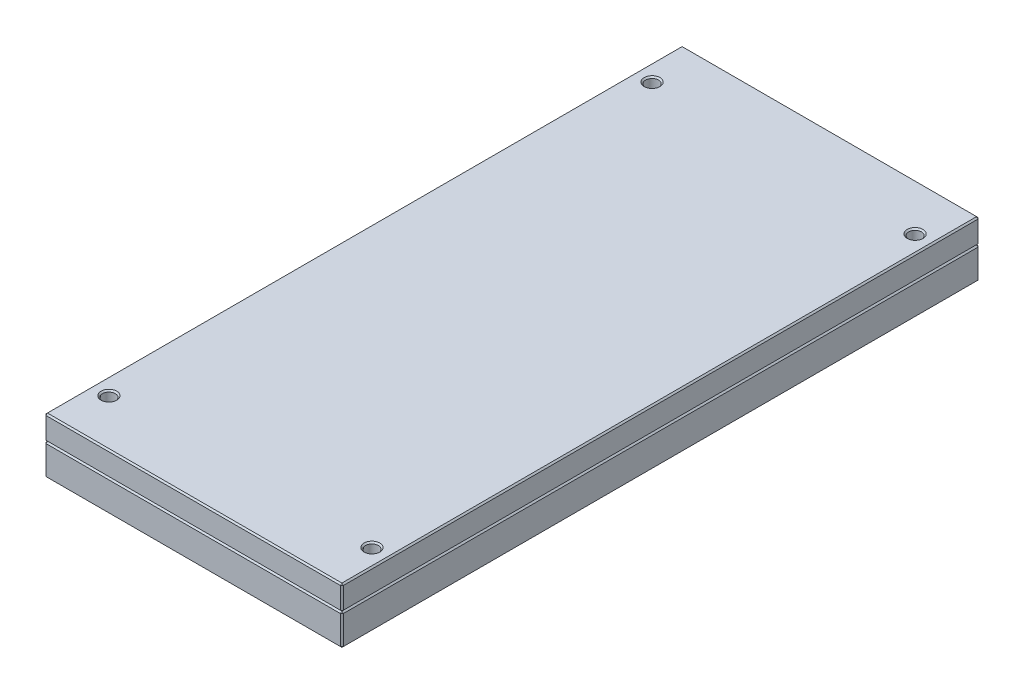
ISO-10303-21;
HEADER;
FILE_DESCRIPTION(('STEP AP214'),'2;1');
FILE_NAME('part.step','',(''),(''),'','','');
FILE_SCHEMA(('AUTOMOTIVE_DESIGN { 1 0 10303 214 1 1 1 1 }'));
ENDSEC;
DATA;
#1=APPLICATION_CONTEXT('core data for automotive mechanical design processes');
#2=APPLICATION_PROTOCOL_DEFINITION('international standard','automotive_design',2000,#1);
#3=PRODUCT_CONTEXT('',#1,'mechanical');
#4=PRODUCT('Part','Part','',(#3));
#5=PRODUCT_RELATED_PRODUCT_CATEGORY('part','',(#4));
#6=PRODUCT_DEFINITION_FORMATION('','',#4);
#7=PRODUCT_DEFINITION_CONTEXT('part definition',#1,'design');
#8=PRODUCT_DEFINITION('design','',#6,#7);
#9=PRODUCT_DEFINITION_SHAPE('','',#8);
#10=(LENGTH_UNIT() NAMED_UNIT(*) SI_UNIT(.MILLI.,.METRE.));
#11=(NAMED_UNIT(*) PLANE_ANGLE_UNIT() SI_UNIT($,.RADIAN.));
#12=(NAMED_UNIT(*) SI_UNIT($,.STERADIAN.) SOLID_ANGLE_UNIT());
#13=UNCERTAINTY_MEASURE_WITH_UNIT(LENGTH_MEASURE(1.E-05),#10,'distance_accuracy_value','');
#14=(GEOMETRIC_REPRESENTATION_CONTEXT(3) GLOBAL_UNCERTAINTY_ASSIGNED_CONTEXT((#13)) GLOBAL_UNIT_ASSIGNED_CONTEXT((#10,
#11,#12)) REPRESENTATION_CONTEXT('',''));
#15=CARTESIAN_POINT('',(0.,0.,0.));
#16=DIRECTION('',(0.,0.,1.));
#17=DIRECTION('',(1.,0.,0.));
#18=AXIS2_PLACEMENT_3D('',#15,#16,#17);
#19=CARTESIAN_POINT('',(-104.,39.,223.));
#20=DIRECTION('',(1.,0.,0.));
#21=DIRECTION('',(0.,0.,-1.));
#22=AXIS2_PLACEMENT_3D('',#19,#20,#21);
#23=PLANE('',#22);
#24=DIRECTION('',(0.,0.,1.));
#25=VECTOR('',#24,1.);
#26=CARTESIAN_POINT('',(-104.,23.,223.));
#27=LINE('',#26,#25);
#28=CARTESIAN_POINT('',(-104.,23.,-222.));
#29=VERTEX_POINT('',#28);
#30=CARTESIAN_POINT('',(-104.,23.,222.));
#31=VERTEX_POINT('',#30);
#32=EDGE_CURVE('P0_E220',#29,#31,#27,.T.);
#33=ORIENTED_EDGE('',*,*,#32,.T.);
#34=DIRECTION('',(0.,1.,0.));
#35=VECTOR('',#34,1.);
#36=CARTESIAN_POINT('',(-104.,39.,222.));
#37=LINE('',#36,#35);
#38=CARTESIAN_POINT('',(-104.,38.,222.));
#39=VERTEX_POINT('',#38);
#40=EDGE_CURVE('P0_E222',#31,#39,#37,.T.);
#41=ORIENTED_EDGE('',*,*,#40,.T.);
#42=DIRECTION('',(0.,0.,-1.));
#43=VECTOR('',#42,1.);
#44=CARTESIAN_POINT('',(-104.,38.,-223.));
#45=LINE('',#44,#43);
#46=CARTESIAN_POINT('',(-104.,38.,-222.));
#47=VERTEX_POINT('',#46);
#48=EDGE_CURVE('P0_E216',#39,#47,#45,.T.);
#49=ORIENTED_EDGE('',*,*,#48,.T.);
#50=DIRECTION('',(0.,-1.,0.));
#51=VECTOR('',#50,1.);
#52=CARTESIAN_POINT('',(-104.,39.,-222.));
#53=LINE('',#52,#51);
#54=EDGE_CURVE('P0_E218',#47,#29,#53,.T.);
#55=ORIENTED_EDGE('',*,*,#54,.T.);
#56=EDGE_LOOP('',(#33,#41,#49,#55));
#57=FACE_BOUND('',#56,.T.);
#58=ADVANCED_FACE('P0_F16',(#57),#23,.F.);
#59=CARTESIAN_POINT('',(104.,39.,223.));
#60=DIRECTION('',(0.,0.,-1.));
#61=DIRECTION('',(-1.,0.,0.));
#62=AXIS2_PLACEMENT_3D('',#59,#60,#61);
#63=PLANE('',#62);
#64=DIRECTION('',(0.,-1.,0.));
#65=VECTOR('',#64,1.);
#66=CARTESIAN_POINT('',(-103.,39.,223.));
#67=LINE('',#66,#65);
#68=CARTESIAN_POINT('',(-103.,38.,223.));
#69=VERTEX_POINT('',#68);
#70=CARTESIAN_POINT('',(-103.,23.,223.));
#71=VERTEX_POINT('',#70);
#72=EDGE_CURVE('P0_E116',#69,#71,#67,.T.);
#73=ORIENTED_EDGE('',*,*,#72,.T.);
#74=DIRECTION('',(1.,0.,0.));
#75=VECTOR('',#74,1.);
#76=CARTESIAN_POINT('',(104.,23.,223.));
#77=LINE('',#76,#75);
#78=CARTESIAN_POINT('',(103.,23.,223.));
#79=VERTEX_POINT('',#78);
#80=EDGE_CURVE('P0_E112',#71,#79,#77,.T.);
#81=ORIENTED_EDGE('',*,*,#80,.T.);
#82=DIRECTION('',(0.,1.,0.));
#83=VECTOR('',#82,1.);
#84=CARTESIAN_POINT('',(103.,39.,223.));
#85=LINE('',#84,#83);
#86=CARTESIAN_POINT('',(103.,38.,223.));
#87=VERTEX_POINT('',#86);
#88=EDGE_CURVE('P0_E106',#79,#87,#85,.T.);
#89=ORIENTED_EDGE('',*,*,#88,.T.);
#90=DIRECTION('',(-1.,0.,0.));
#91=VECTOR('',#90,1.);
#92=CARTESIAN_POINT('',(-104.,38.,223.));
#93=LINE('',#92,#91);
#94=EDGE_CURVE('P0_E109',#87,#69,#93,.T.);
#95=ORIENTED_EDGE('',*,*,#94,.T.);
#96=EDGE_LOOP('',(#73,#81,#89,#95));
#97=FACE_BOUND('',#96,.T.);
#98=ADVANCED_FACE('P0_F108',(#97),#63,.F.);
#99=CARTESIAN_POINT('',(104.,39.,223.));
#100=DIRECTION('',(-1.,0.,0.));
#101=DIRECTION('',(0.,0.,1.));
#102=AXIS2_PLACEMENT_3D('',#99,#100,#101);
#103=PLANE('',#102);
#104=DIRECTION('',(0.,0.,1.));
#105=VECTOR('',#104,1.);
#106=CARTESIAN_POINT('',(104.,38.,223.));
#107=LINE('',#106,#105);
#108=CARTESIAN_POINT('',(104.,38.,-222.));
#109=VERTEX_POINT('',#108);
#110=CARTESIAN_POINT('',(104.,38.,222.));
#111=VERTEX_POINT('',#110);
#112=EDGE_CURVE('P0_E234',#109,#111,#107,.T.);
#113=ORIENTED_EDGE('',*,*,#112,.T.);
#114=DIRECTION('',(0.,-1.,0.));
#115=VECTOR('',#114,1.);
#116=CARTESIAN_POINT('',(104.,39.,222.));
#117=LINE('',#116,#115);
#118=CARTESIAN_POINT('',(104.,23.,222.));
#119=VERTEX_POINT('',#118);
#120=EDGE_CURVE('P0_E139',#111,#119,#117,.T.);
#121=ORIENTED_EDGE('',*,*,#120,.T.);
#122=DIRECTION('',(0.,0.,-1.));
#123=VECTOR('',#122,1.);
#124=CARTESIAN_POINT('',(104.,23.,223.));
#125=LINE('',#124,#123);
#126=CARTESIAN_POINT('',(104.,23.,-222.));
#127=VERTEX_POINT('',#126);
#128=EDGE_CURVE('P0_E238',#119,#127,#125,.T.);
#129=ORIENTED_EDGE('',*,*,#128,.T.);
#130=DIRECTION('',(0.,1.,0.));
#131=VECTOR('',#130,1.);
#132=CARTESIAN_POINT('',(104.,39.,-222.));
#133=LINE('',#132,#131);
#134=EDGE_CURVE('P0_E236',#127,#109,#133,.T.);
#135=ORIENTED_EDGE('',*,*,#134,.T.);
#136=EDGE_LOOP('',(#113,#121,#129,#135));
#137=FACE_BOUND('',#136,.T.);
#138=ADVANCED_FACE('P0_F307',(#137),#103,.F.);
#139=CARTESIAN_POINT('',(104.,39.,-223.));
#140=DIRECTION('',(0.,0.,1.));
#141=DIRECTION('',(1.,0.,0.));
#142=AXIS2_PLACEMENT_3D('',#139,#140,#141);
#143=PLANE('',#142);
#144=DIRECTION('',(-1.,0.,0.));
#145=VECTOR('',#144,1.);
#146=CARTESIAN_POINT('',(104.,23.,-223.));
#147=LINE('',#146,#145);
#148=CARTESIAN_POINT('',(103.,23.,-223.));
#149=VERTEX_POINT('',#148);
#150=CARTESIAN_POINT('',(-103.,23.,-223.));
#151=VERTEX_POINT('',#150);
#152=EDGE_CURVE('P0_E229',#149,#151,#147,.T.);
#153=ORIENTED_EDGE('',*,*,#152,.T.);
#154=DIRECTION('',(0.,1.,0.));
#155=VECTOR('',#154,1.);
#156=CARTESIAN_POINT('',(-103.,39.,-223.));
#157=LINE('',#156,#155);
#158=CARTESIAN_POINT('',(-103.,38.,-223.));
#159=VERTEX_POINT('',#158);
#160=EDGE_CURVE('P0_E231',#151,#159,#157,.T.);
#161=ORIENTED_EDGE('',*,*,#160,.T.);
#162=DIRECTION('',(1.,0.,0.));
#163=VECTOR('',#162,1.);
#164=CARTESIAN_POINT('',(104.,38.,-223.));
#165=LINE('',#164,#163);
#166=CARTESIAN_POINT('',(103.,38.,-223.));
#167=VERTEX_POINT('',#166);
#168=EDGE_CURVE('P0_E225',#159,#167,#165,.T.);
#169=ORIENTED_EDGE('',*,*,#168,.T.);
#170=DIRECTION('',(0.,-1.,0.));
#171=VECTOR('',#170,1.);
#172=CARTESIAN_POINT('',(103.,39.,-223.));
#173=LINE('',#172,#171);
#174=EDGE_CURVE('P0_E227',#167,#149,#173,.T.);
#175=ORIENTED_EDGE('',*,*,#174,.T.);
#176=EDGE_LOOP('',(#153,#161,#169,#175));
#177=FACE_BOUND('',#176,.T.);
#178=ADVANCED_FACE('P0_F318',(#177),#143,.F.);
#179=CARTESIAN_POINT('',(0.,39.,0.));
#180=DIRECTION('',(0.,1.,0.));
#181=DIRECTION('',(0.,0.,1.));
#182=AXIS2_PLACEMENT_3D('',#179,#180,#181);
#183=PLANE('',#182);
#184=DIRECTION('',(0.,0.,-1.));
#185=VECTOR('',#184,1.);
#186=CARTESIAN_POINT('',(103.,39.,-223.));
#187=LINE('',#186,#185);
#188=CARTESIAN_POINT('',(103.,39.,222.));
#189=VERTEX_POINT('',#188);
#190=CARTESIAN_POINT('',(103.,39.,-222.));
#191=VERTEX_POINT('',#190);
#192=EDGE_CURVE('P0_E33',#189,#191,#187,.T.);
#193=ORIENTED_EDGE('',*,*,#192,.T.);
#194=DIRECTION('',(-1.,0.,0.));
#195=VECTOR('',#194,1.);
#196=CARTESIAN_POINT('',(-104.,39.,-222.));
#197=LINE('',#196,#195);
#198=CARTESIAN_POINT('',(-103.,39.,-222.));
#199=VERTEX_POINT('',#198);
#200=EDGE_CURVE('P0_E257',#191,#199,#197,.T.);
#201=ORIENTED_EDGE('',*,*,#200,.T.);
#202=DIRECTION('',(0.,0.,1.));
#203=VECTOR('',#202,1.);
#204=CARTESIAN_POINT('',(-103.,39.,223.));
#205=LINE('',#204,#203);
#206=CARTESIAN_POINT('',(-103.,39.,222.));
#207=VERTEX_POINT('',#206);
#208=EDGE_CURVE('P0_E253',#199,#207,#205,.T.);
#209=ORIENTED_EDGE('',*,*,#208,.T.);
#210=DIRECTION('',(1.,0.,0.));
#211=VECTOR('',#210,1.);
#212=CARTESIAN_POINT('',(104.,39.,222.));
#213=LINE('',#212,#211);
#214=EDGE_CURVE('P0_E38',#207,#189,#213,.T.);
#215=ORIENTED_EDGE('',*,*,#214,.T.);
#216=EDGE_LOOP('',(#193,#201,#209,#215));
#217=FACE_BOUND('',#216,.T.);
#218=CARTESIAN_POINT('',(92.,39.,190.));
#219=DIRECTION('',(0.,1.,0.));
#220=DIRECTION('',(0.,0.,1.));
#221=AXIS2_PLACEMENT_3D('',#218,#219,#220);
#222=CIRCLE('',#221,5.5);
#223=CARTESIAN_POINT('',(92.,39.,195.5));
#224=VERTEX_POINT('',#223);
#225=EDGE_CURVE('P0_E250',#224,#224,#222,.F.);
#226=ORIENTED_EDGE('',*,*,#225,.T.);
#227=EDGE_LOOP('',(#226));
#228=FACE_BOUND('',#227,.T.);
#229=CARTESIAN_POINT('',(-92.,39.,190.));
#230=DIRECTION('',(0.,1.,0.));
#231=DIRECTION('',(0.,0.,1.));
#232=AXIS2_PLACEMENT_3D('',#229,#230,#231);
#233=CIRCLE('',#232,5.5);
#234=CARTESIAN_POINT('',(-92.,39.,195.5));
#235=VERTEX_POINT('',#234);
#236=EDGE_CURVE('P0_E247',#235,#235,#233,.F.);
#237=ORIENTED_EDGE('',*,*,#236,.T.);
#238=EDGE_LOOP('',(#237));
#239=FACE_BOUND('',#238,.T.);
#240=CARTESIAN_POINT('',(92.,39.,-190.));
#241=DIRECTION('',(0.,1.,0.));
#242=DIRECTION('',(0.,0.,1.));
#243=AXIS2_PLACEMENT_3D('',#240,#241,#242);
#244=CIRCLE('',#243,5.5);
#245=CARTESIAN_POINT('',(92.,39.,-184.5));
#246=VERTEX_POINT('',#245);
#247=EDGE_CURVE('P0_E244',#246,#246,#244,.F.);
#248=ORIENTED_EDGE('',*,*,#247,.T.);
#249=EDGE_LOOP('',(#248));
#250=FACE_BOUND('',#249,.T.);
#251=CARTESIAN_POINT('',(-92.,39.,-190.));
#252=DIRECTION('',(0.,1.,0.));
#253=DIRECTION('',(0.,0.,1.));
#254=AXIS2_PLACEMENT_3D('',#251,#252,#253);
#255=CIRCLE('',#254,5.5);
#256=CARTESIAN_POINT('',(-92.,39.,-184.5));
#257=VERTEX_POINT('',#256);
#258=EDGE_CURVE('P0_E241',#257,#257,#255,.F.);
#259=ORIENTED_EDGE('',*,*,#258,.T.);
#260=EDGE_LOOP('',(#259));
#261=FACE_BOUND('',#260,.T.);
#262=ADVANCED_FACE('P0_F335',(#217,#228,#239,#250,#261),#183,.T.);
#263=CARTESIAN_POINT('',(0.,22.,0.));
#264=DIRECTION('',(0.,1.,0.));
#265=DIRECTION('',(0.,0.,1.));
#266=AXIS2_PLACEMENT_3D('',#263,#264,#265);
#267=PLANE('',#266);
#268=DIRECTION('',(0.,0.,1.));
#269=VECTOR('',#268,1.);
#270=CARTESIAN_POINT('',(103.,22.,0.));
#271=LINE('',#270,#269);
#272=CARTESIAN_POINT('',(103.,22.,-222.));
#273=VERTEX_POINT('',#272);
#274=CARTESIAN_POINT('',(103.,22.,222.));
#275=VERTEX_POINT('',#274);
#276=EDGE_CURVE('P0_E207',#273,#275,#271,.T.);
#277=ORIENTED_EDGE('',*,*,#276,.T.);
#278=DIRECTION('',(-1.,0.,0.));
#279=VECTOR('',#278,1.);
#280=CARTESIAN_POINT('',(0.,22.,222.));
#281=LINE('',#280,#279);
#282=CARTESIAN_POINT('',(-103.,22.,222.));
#283=VERTEX_POINT('',#282);
#284=EDGE_CURVE('P0_E213',#275,#283,#281,.T.);
#285=ORIENTED_EDGE('',*,*,#284,.T.);
#286=DIRECTION('',(0.,0.,-1.));
#287=VECTOR('',#286,1.);
#288=CARTESIAN_POINT('',(-103.,22.,0.));
#289=LINE('',#288,#287);
#290=CARTESIAN_POINT('',(-103.,22.,-222.));
#291=VERTEX_POINT('',#290);
#292=EDGE_CURVE('P0_E211',#283,#291,#289,.T.);
#293=ORIENTED_EDGE('',*,*,#292,.T.);
#294=DIRECTION('',(1.,0.,0.));
#295=VECTOR('',#294,1.);
#296=CARTESIAN_POINT('',(0.,22.,-222.));
#297=LINE('',#296,#295);
#298=EDGE_CURVE('P0_E209',#291,#273,#297,.T.);
#299=ORIENTED_EDGE('',*,*,#298,.T.);
#300=EDGE_LOOP('',(#277,#285,#293,#299));
#301=FACE_BOUND('',#300,.T.);
#302=CARTESIAN_POINT('',(-92.,22.,-190.));
#303=DIRECTION('',(0.,1.,0.));
#304=DIRECTION('',(0.,0.,1.));
#305=AXIS2_PLACEMENT_3D('',#302,#303,#304);
#306=CIRCLE('',#305,4.5);
#307=CARTESIAN_POINT('',(-92.,22.,-185.5));
#308=VERTEX_POINT('',#307);
#309=EDGE_CURVE('P0_E127',#308,#308,#306,.T.);
#310=ORIENTED_EDGE('',*,*,#309,.T.);
#311=EDGE_LOOP('',(#310));
#312=FACE_BOUND('',#311,.T.);
#313=CARTESIAN_POINT('',(92.,22.,-190.));
#314=DIRECTION('',(0.,1.,0.));
#315=DIRECTION('',(0.,0.,1.));
#316=AXIS2_PLACEMENT_3D('',#313,#314,#315);
#317=CIRCLE('',#316,4.5);
#318=CARTESIAN_POINT('',(92.,22.,-185.5));
#319=VERTEX_POINT('',#318);
#320=EDGE_CURVE('P0_E198',#319,#319,#317,.T.);
#321=ORIENTED_EDGE('',*,*,#320,.T.);
#322=EDGE_LOOP('',(#321));
#323=FACE_BOUND('',#322,.T.);
#324=CARTESIAN_POINT('',(-92.,22.,190.));
#325=DIRECTION('',(0.,1.,0.));
#326=DIRECTION('',(0.,0.,1.));
#327=AXIS2_PLACEMENT_3D('',#324,#325,#326);
#328=CIRCLE('',#327,4.5);
#329=CARTESIAN_POINT('',(-92.,22.,194.5));
#330=VERTEX_POINT('',#329);
#331=EDGE_CURVE('P0_E193',#330,#330,#328,.T.);
#332=ORIENTED_EDGE('',*,*,#331,.T.);
#333=EDGE_LOOP('',(#332));
#334=FACE_BOUND('',#333,.T.);
#335=CARTESIAN_POINT('',(92.,22.,190.));
#336=DIRECTION('',(0.,1.,0.));
#337=DIRECTION('',(0.,0.,1.));
#338=AXIS2_PLACEMENT_3D('',#335,#336,#337);
#339=CIRCLE('',#338,4.5);
#340=CARTESIAN_POINT('',(92.,22.,194.5));
#341=VERTEX_POINT('',#340);
#342=EDGE_CURVE('P0_E186',#341,#341,#339,.T.);
#343=ORIENTED_EDGE('',*,*,#342,.T.);
#344=EDGE_LOOP('',(#343));
#345=FACE_BOUND('',#344,.T.);
#346=ADVANCED_FACE('P0_F292',(#301,#312,#323,#334,#345),#267,.F.);
#347=CARTESIAN_POINT('',(92.,0.,190.));
#348=DIRECTION('',(0.,1.,0.));
#349=DIRECTION('',(0.,0.,1.));
#350=AXIS2_PLACEMENT_3D('',#347,#348,#349);
#351=CYLINDRICAL_SURFACE('',#350,4.5);
#352=CARTESIAN_POINT('',(92.,38.,190.));
#353=DIRECTION('',(0.,1.,0.));
#354=DIRECTION('',(0.,0.,1.));
#355=AXIS2_PLACEMENT_3D('',#352,#353,#354);
#356=CIRCLE('',#355,4.5);
#357=CARTESIAN_POINT('',(92.,38.,194.5));
#358=VERTEX_POINT('',#357);
#359=EDGE_CURVE('P0_E259',#358,#358,#356,.T.);
#360=ORIENTED_EDGE('',*,*,#359,.T.);
#361=EDGE_LOOP('',(#360));
#362=FACE_BOUND('',#361,.T.);
#363=ORIENTED_EDGE('',*,*,#342,.F.);
#364=EDGE_LOOP('',(#363));
#365=FACE_BOUND('',#364,.T.);
#366=ADVANCED_FACE('P0_F427',(#362,#365),#351,.F.);
#367=CARTESIAN_POINT('',(-92.,0.,190.));
#368=DIRECTION('',(0.,1.,0.));
#369=DIRECTION('',(0.,0.,1.));
#370=AXIS2_PLACEMENT_3D('',#367,#368,#369);
#371=CYLINDRICAL_SURFACE('',#370,4.5);
#372=CARTESIAN_POINT('',(-92.,38.,190.));
#373=DIRECTION('',(0.,1.,0.));
#374=DIRECTION('',(0.,0.,1.));
#375=AXIS2_PLACEMENT_3D('',#372,#373,#374);
#376=CIRCLE('',#375,4.5);
#377=CARTESIAN_POINT('',(-92.,38.,194.5));
#378=VERTEX_POINT('',#377);
#379=EDGE_CURVE('P0_E262',#378,#378,#376,.T.);
#380=ORIENTED_EDGE('',*,*,#379,.T.);
#381=EDGE_LOOP('',(#380));
#382=FACE_BOUND('',#381,.T.);
#383=ORIENTED_EDGE('',*,*,#331,.F.);
#384=EDGE_LOOP('',(#383));
#385=FACE_BOUND('',#384,.T.);
#386=ADVANCED_FACE('P0_F421',(#382,#385),#371,.F.);
#387=CARTESIAN_POINT('',(92.,0.,-190.));
#388=DIRECTION('',(0.,1.,0.));
#389=DIRECTION('',(0.,0.,1.));
#390=AXIS2_PLACEMENT_3D('',#387,#388,#389);
#391=CYLINDRICAL_SURFACE('',#390,4.5);
#392=CARTESIAN_POINT('',(92.,38.,-190.));
#393=DIRECTION('',(0.,1.,0.));
#394=DIRECTION('',(0.,0.,1.));
#395=AXIS2_PLACEMENT_3D('',#392,#393,#394);
#396=CIRCLE('',#395,4.5);
#397=CARTESIAN_POINT('',(92.,38.,-185.5));
#398=VERTEX_POINT('',#397);
#399=EDGE_CURVE('P0_E25',#398,#398,#396,.T.);
#400=ORIENTED_EDGE('',*,*,#399,.T.);
#401=EDGE_LOOP('',(#400));
#402=FACE_BOUND('',#401,.T.);
#403=ORIENTED_EDGE('',*,*,#320,.F.);
#404=EDGE_LOOP('',(#403));
#405=FACE_BOUND('',#404,.T.);
#406=ADVANCED_FACE('P0_F418',(#402,#405),#391,.F.);
#407=CARTESIAN_POINT('',(-92.,0.,-190.));
#408=DIRECTION('',(0.,1.,0.));
#409=DIRECTION('',(0.,0.,1.));
#410=AXIS2_PLACEMENT_3D('',#407,#408,#409);
#411=CYLINDRICAL_SURFACE('',#410,4.5);
#412=CARTESIAN_POINT('',(-92.,38.,-190.));
#413=DIRECTION('',(0.,1.,0.));
#414=DIRECTION('',(0.,0.,1.));
#415=AXIS2_PLACEMENT_3D('',#412,#413,#414);
#416=CIRCLE('',#415,4.5);
#417=CARTESIAN_POINT('',(-92.,38.,-185.5));
#418=VERTEX_POINT('',#417);
#419=EDGE_CURVE('P0_E10',#418,#418,#416,.T.);
#420=ORIENTED_EDGE('',*,*,#419,.T.);
#421=EDGE_LOOP('',(#420));
#422=FACE_BOUND('',#421,.T.);
#423=ORIENTED_EDGE('',*,*,#309,.F.);
#424=EDGE_LOOP('',(#423));
#425=FACE_BOUND('',#424,.T.);
#426=ADVANCED_FACE('P0_F399',(#422,#425),#411,.F.);
#427=CARTESIAN_POINT('',(0.,39.,-222.));
#428=DIRECTION('',(0.,0.707106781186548,-0.707106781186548));
#429=DIRECTION('',(1.,0.,0.));
#430=AXIS2_PLACEMENT_3D('',#427,#428,#429);
#431=PLANE('',#430);
#432=DIRECTION('',(0.,-0.707106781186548,-0.707106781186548));
#433=VECTOR('',#432,1.);
#434=CARTESIAN_POINT('',(-103.,38.,-223.));
#435=LINE('',#434,#433);
#436=EDGE_CURVE('P0_E20',#199,#159,#435,.T.);
#437=ORIENTED_EDGE('',*,*,#436,.F.);
#438=ORIENTED_EDGE('',*,*,#200,.F.);
#439=DIRECTION('',(0.,0.707106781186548,0.707106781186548));
#440=VECTOR('',#439,1.);
#441=CARTESIAN_POINT('',(103.,38.5,-222.5));
#442=LINE('',#441,#440);
#443=EDGE_CURVE('P0_E179',#167,#191,#442,.T.);
#444=ORIENTED_EDGE('',*,*,#443,.F.);
#445=ORIENTED_EDGE('',*,*,#168,.F.);
#446=EDGE_LOOP('',(#437,#438,#444,#445));
#447=FACE_BOUND('',#446,.T.);
#448=ADVANCED_FACE('P0_F334',(#447),#431,.T.);
#449=CARTESIAN_POINT('',(-103.,38.,-223.));
#450=DIRECTION('',(-0.577350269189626,0.577350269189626,-0.577350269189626));
#451=DIRECTION('',(-0.707106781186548,0.,0.707106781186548));
#452=AXIS2_PLACEMENT_3D('',#449,#450,#451);
#453=PLANE('',#452);
#454=DIRECTION('',(0.707106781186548,0.707106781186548,0.));
#455=VECTOR('',#454,1.);
#456=CARTESIAN_POINT('',(-103.5,38.5,-222.));
#457=LINE('',#456,#455);
#458=EDGE_CURVE('P0_E175',#199,#47,#457,.F.);
#459=ORIENTED_EDGE('',*,*,#458,.F.);
#460=ORIENTED_EDGE('',*,*,#436,.T.);
#461=DIRECTION('',(0.707106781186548,0.,-0.707106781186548));
#462=VECTOR('',#461,1.);
#463=CARTESIAN_POINT('',(-103.,38.,-223.));
#464=LINE('',#463,#462);
#465=EDGE_CURVE('P0_E178',#47,#159,#464,.T.);
#466=ORIENTED_EDGE('',*,*,#465,.F.);
#467=EDGE_LOOP('',(#459,#460,#466));
#468=FACE_BOUND('',#467,.T.);
#469=ADVANCED_FACE('P0_F330',(#468),#453,.T.);
#470=CARTESIAN_POINT('',(104.,38.,-222.));
#471=DIRECTION('',(0.577350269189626,0.577350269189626,-0.577350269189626));
#472=DIRECTION('',(-0.707106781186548,0.,-0.707106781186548));
#473=AXIS2_PLACEMENT_3D('',#470,#471,#472);
#474=PLANE('',#473);
#475=DIRECTION('',(0.707106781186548,0.,0.707106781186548));
#476=VECTOR('',#475,1.);
#477=CARTESIAN_POINT('',(104.,38.,-222.));
#478=LINE('',#477,#476);
#479=EDGE_CURVE('P0_E169',#167,#109,#478,.T.);
#480=ORIENTED_EDGE('',*,*,#479,.F.);
#481=ORIENTED_EDGE('',*,*,#443,.T.);
#482=DIRECTION('',(0.707106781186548,-0.707106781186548,0.));
#483=VECTOR('',#482,1.);
#484=CARTESIAN_POINT('',(104.,38.,-222.));
#485=LINE('',#484,#483);
#486=EDGE_CURVE('P0_E172',#109,#191,#485,.F.);
#487=ORIENTED_EDGE('',*,*,#486,.F.);
#488=EDGE_LOOP('',(#480,#481,#487));
#489=FACE_BOUND('',#488,.T.);
#490=ADVANCED_FACE('P0_F311',(#489),#474,.T.);
#491=CARTESIAN_POINT('',(-104.,39.,-222.));
#492=DIRECTION('',(0.707106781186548,0.,0.707106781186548));
#493=DIRECTION('',(0.,-1.,0.));
#494=AXIS2_PLACEMENT_3D('',#491,#492,#493);
#495=PLANE('',#494);
#496=ORIENTED_EDGE('',*,*,#465,.T.);
#497=ORIENTED_EDGE('',*,*,#160,.F.);
#498=DIRECTION('',(-0.707106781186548,0.,0.707106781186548));
#499=VECTOR('',#498,1.);
#500=CARTESIAN_POINT('',(-103.5,23.,-222.5));
#501=LINE('',#500,#499);
#502=EDGE_CURVE('P0_E163',#29,#151,#501,.F.);
#503=ORIENTED_EDGE('',*,*,#502,.F.);
#504=ORIENTED_EDGE('',*,*,#54,.F.);
#505=EDGE_LOOP('',(#496,#497,#503,#504));
#506=FACE_BOUND('',#505,.T.);
#507=ADVANCED_FACE('P0_F329',(#506),#495,.F.);
#508=CARTESIAN_POINT('',(-103.,39.,0.));
#509=DIRECTION('',(-0.707106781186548,0.707106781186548,0.));
#510=DIRECTION('',(0.,0.,-1.));
#511=AXIS2_PLACEMENT_3D('',#508,#509,#510);
#512=PLANE('',#511);
#513=ORIENTED_EDGE('',*,*,#458,.T.);
#514=ORIENTED_EDGE('',*,*,#48,.F.);
#515=DIRECTION('',(-0.707106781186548,-0.707106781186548,0.));
#516=VECTOR('',#515,1.);
#517=CARTESIAN_POINT('',(-104.,38.,222.));
#518=LINE('',#517,#516);
#519=EDGE_CURVE('P0_E160',#207,#39,#518,.T.);
#520=ORIENTED_EDGE('',*,*,#519,.F.);
#521=ORIENTED_EDGE('',*,*,#208,.F.);
#522=EDGE_LOOP('',(#513,#514,#520,#521));
#523=FACE_BOUND('',#522,.T.);
#524=ADVANCED_FACE('P0_F338',(#523),#512,.T.);
#525=CARTESIAN_POINT('',(0.,39.,222.));
#526=DIRECTION('',(0.,0.707106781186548,0.707106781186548));
#527=DIRECTION('',(-1.,0.,0.));
#528=AXIS2_PLACEMENT_3D('',#525,#526,#527);
#529=PLANE('',#528);
#530=DIRECTION('',(0.,-0.707106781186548,0.707106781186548));
#531=VECTOR('',#530,1.);
#532=CARTESIAN_POINT('',(103.,38.,223.));
#533=LINE('',#532,#531);
#534=EDGE_CURVE('P0_E122',#189,#87,#533,.T.);
#535=ORIENTED_EDGE('',*,*,#534,.F.);
#536=ORIENTED_EDGE('',*,*,#214,.F.);
#537=DIRECTION('',(0.,0.707106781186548,-0.707106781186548));
#538=VECTOR('',#537,1.);
#539=CARTESIAN_POINT('',(-103.,38.5,222.5));
#540=LINE('',#539,#538);
#541=EDGE_CURVE('P0_E125',#69,#207,#540,.T.);
#542=ORIENTED_EDGE('',*,*,#541,.F.);
#543=ORIENTED_EDGE('',*,*,#94,.F.);
#544=EDGE_LOOP('',(#535,#536,#542,#543));
#545=FACE_BOUND('',#544,.T.);
#546=ADVANCED_FACE('P0_F121',(#545),#529,.T.);
#547=CARTESIAN_POINT('',(103.,39.,0.));
#548=DIRECTION('',(0.707106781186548,0.707106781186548,0.));
#549=DIRECTION('',(0.,0.,1.));
#550=AXIS2_PLACEMENT_3D('',#547,#548,#549);
#551=PLANE('',#550);
#552=ORIENTED_EDGE('',*,*,#486,.T.);
#553=ORIENTED_EDGE('',*,*,#192,.F.);
#554=DIRECTION('',(-0.707106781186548,0.707106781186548,0.));
#555=VECTOR('',#554,1.);
#556=CARTESIAN_POINT('',(103.5,38.5,222.));
#557=LINE('',#556,#555);
#558=EDGE_CURVE('P0_E135',#111,#189,#557,.T.);
#559=ORIENTED_EDGE('',*,*,#558,.F.);
#560=ORIENTED_EDGE('',*,*,#112,.F.);
#561=EDGE_LOOP('',(#552,#553,#559,#560));
#562=FACE_BOUND('',#561,.T.);
#563=ADVANCED_FACE('P0_F310',(#562),#551,.T.);
#564=CARTESIAN_POINT('',(103.,39.,-223.));
#565=DIRECTION('',(-0.707106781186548,0.,0.707106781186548));
#566=DIRECTION('',(0.,-1.,0.));
#567=AXIS2_PLACEMENT_3D('',#564,#565,#566);
#568=PLANE('',#567);
#569=ORIENTED_EDGE('',*,*,#479,.T.);
#570=ORIENTED_EDGE('',*,*,#134,.F.);
#571=DIRECTION('',(-0.707106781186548,0.,-0.707106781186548));
#572=VECTOR('',#571,1.);
#573=CARTESIAN_POINT('',(103.5,23.,-222.5));
#574=LINE('',#573,#572);
#575=EDGE_CURVE('P0_E155',#149,#127,#574,.F.);
#576=ORIENTED_EDGE('',*,*,#575,.F.);
#577=ORIENTED_EDGE('',*,*,#174,.F.);
#578=EDGE_LOOP('',(#569,#570,#576,#577));
#579=FACE_BOUND('',#578,.T.);
#580=ADVANCED_FACE('P0_F315',(#579),#568,.F.);
#581=CARTESIAN_POINT('',(104.,23.,-223.));
#582=DIRECTION('',(0.,0.707106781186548,0.707106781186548));
#583=DIRECTION('',(-1.,0.,0.));
#584=AXIS2_PLACEMENT_3D('',#581,#582,#583);
#585=PLANE('',#584);
#586=DIRECTION('',(0.,0.707106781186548,-0.707106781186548));
#587=VECTOR('',#586,1.);
#588=CARTESIAN_POINT('',(-103.,22.,-222.));
#589=LINE('',#588,#587);
#590=EDGE_CURVE('P0_E166',#151,#291,#589,.F.);
#591=ORIENTED_EDGE('',*,*,#590,.F.);
#592=ORIENTED_EDGE('',*,*,#152,.F.);
#593=DIRECTION('',(0.,-0.707106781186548,0.707106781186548));
#594=VECTOR('',#593,1.);
#595=CARTESIAN_POINT('',(103.,22.,-222.));
#596=LINE('',#595,#594);
#597=EDGE_CURVE('P0_E152',#273,#149,#596,.F.);
#598=ORIENTED_EDGE('',*,*,#597,.F.);
#599=ORIENTED_EDGE('',*,*,#298,.F.);
#600=EDGE_LOOP('',(#591,#592,#598,#599));
#601=FACE_BOUND('',#600,.T.);
#602=ADVANCED_FACE('P0_F323',(#601),#585,.F.);
#603=CARTESIAN_POINT('',(-103.,22.,-222.));
#604=DIRECTION('',(-0.577350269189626,-0.577350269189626,-0.577350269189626));
#605=DIRECTION('',(-0.707106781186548,0.,0.707106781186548));
#606=AXIS2_PLACEMENT_3D('',#603,#604,#605);
#607=PLANE('',#606);
#608=ORIENTED_EDGE('',*,*,#502,.T.);
#609=ORIENTED_EDGE('',*,*,#590,.T.);
#610=DIRECTION('',(0.707106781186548,-0.707106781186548,0.));
#611=VECTOR('',#610,1.);
#612=CARTESIAN_POINT('',(-103.,22.,-222.));
#613=LINE('',#612,#611);
#614=EDGE_CURVE('P0_E143',#29,#291,#613,.T.);
#615=ORIENTED_EDGE('',*,*,#614,.F.);
#616=EDGE_LOOP('',(#608,#609,#615));
#617=FACE_BOUND('',#616,.T.);
#618=ADVANCED_FACE('P0_F326',(#617),#607,.T.);
#619=CARTESIAN_POINT('',(-104.,38.,222.));
#620=DIRECTION('',(-0.577350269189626,0.577350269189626,0.577350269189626));
#621=DIRECTION('',(0.707106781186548,0.,0.707106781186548));
#622=AXIS2_PLACEMENT_3D('',#619,#620,#621);
#623=PLANE('',#622);
#624=ORIENTED_EDGE('',*,*,#541,.T.);
#625=ORIENTED_EDGE('',*,*,#519,.T.);
#626=DIRECTION('',(-0.707106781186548,0.,-0.707106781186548));
#627=VECTOR('',#626,1.);
#628=CARTESIAN_POINT('',(-104.,38.,222.));
#629=LINE('',#628,#627);
#630=EDGE_CURVE('P0_E140',#69,#39,#629,.T.);
#631=ORIENTED_EDGE('',*,*,#630,.F.);
#632=EDGE_LOOP('',(#624,#625,#631));
#633=FACE_BOUND('',#632,.T.);
#634=ADVANCED_FACE('P0_F340',(#633),#623,.T.);
#635=CARTESIAN_POINT('',(103.,38.,223.));
#636=DIRECTION('',(0.577350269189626,0.577350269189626,0.577350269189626));
#637=DIRECTION('',(0.707106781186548,0.,-0.707106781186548));
#638=AXIS2_PLACEMENT_3D('',#635,#636,#637);
#639=PLANE('',#638);
#640=ORIENTED_EDGE('',*,*,#558,.T.);
#641=ORIENTED_EDGE('',*,*,#534,.T.);
#642=DIRECTION('',(-0.707106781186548,0.,0.707106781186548));
#643=VECTOR('',#642,1.);
#644=CARTESIAN_POINT('',(103.,38.,223.));
#645=LINE('',#644,#643);
#646=EDGE_CURVE('P0_E132',#111,#87,#645,.T.);
#647=ORIENTED_EDGE('',*,*,#646,.F.);
#648=EDGE_LOOP('',(#640,#641,#647));
#649=FACE_BOUND('',#648,.T.);
#650=ADVANCED_FACE('P0_F131',(#649),#639,.T.);
#651=CARTESIAN_POINT('',(103.,22.,-222.));
#652=DIRECTION('',(0.577350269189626,-0.577350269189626,-0.577350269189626));
#653=DIRECTION('',(-0.707106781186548,0.,-0.707106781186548));
#654=AXIS2_PLACEMENT_3D('',#651,#652,#653);
#655=PLANE('',#654);
#656=ORIENTED_EDGE('',*,*,#597,.T.);
#657=ORIENTED_EDGE('',*,*,#575,.T.);
#658=DIRECTION('',(0.707106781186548,0.707106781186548,0.));
#659=VECTOR('',#658,1.);
#660=CARTESIAN_POINT('',(103.,22.,-222.));
#661=LINE('',#660,#659);
#662=EDGE_CURVE('P0_E141',#273,#127,#661,.T.);
#663=ORIENTED_EDGE('',*,*,#662,.F.);
#664=EDGE_LOOP('',(#656,#657,#663));
#665=FACE_BOUND('',#664,.T.);
#666=ADVANCED_FACE('P0_F371',(#665),#655,.T.);
#667=CARTESIAN_POINT('',(-104.,23.,223.));
#668=DIRECTION('',(0.707106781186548,0.707106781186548,0.));
#669=DIRECTION('',(0.,0.,1.));
#670=AXIS2_PLACEMENT_3D('',#667,#668,#669);
#671=PLANE('',#670);
#672=ORIENTED_EDGE('',*,*,#614,.T.);
#673=ORIENTED_EDGE('',*,*,#292,.F.);
#674=DIRECTION('',(-0.707106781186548,0.707106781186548,0.));
#675=VECTOR('',#674,1.);
#676=CARTESIAN_POINT('',(-103.,22.,222.));
#677=LINE('',#676,#675);
#678=EDGE_CURVE('P0_E146',#31,#283,#677,.F.);
#679=ORIENTED_EDGE('',*,*,#678,.F.);
#680=ORIENTED_EDGE('',*,*,#32,.F.);
#681=EDGE_LOOP('',(#672,#673,#679,#680));
#682=FACE_BOUND('',#681,.T.);
#683=ADVANCED_FACE('P0_F287',(#682),#671,.F.);
#684=CARTESIAN_POINT('',(-103.,39.,223.));
#685=DIRECTION('',(0.707106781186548,0.,-0.707106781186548));
#686=DIRECTION('',(0.,-1.,0.));
#687=AXIS2_PLACEMENT_3D('',#684,#685,#686);
#688=PLANE('',#687);
#689=ORIENTED_EDGE('',*,*,#630,.T.);
#690=ORIENTED_EDGE('',*,*,#40,.F.);
#691=DIRECTION('',(0.707106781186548,0.,0.707106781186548));
#692=VECTOR('',#691,1.);
#693=CARTESIAN_POINT('',(-103.5,23.,222.5));
#694=LINE('',#693,#692);
#695=EDGE_CURVE('P0_E276',#71,#31,#694,.F.);
#696=ORIENTED_EDGE('',*,*,#695,.F.);
#697=ORIENTED_EDGE('',*,*,#72,.F.);
#698=EDGE_LOOP('',(#689,#690,#696,#697));
#699=FACE_BOUND('',#698,.T.);
#700=ADVANCED_FACE('P0_F344',(#699),#688,.F.);
#701=CARTESIAN_POINT('',(104.,39.,222.));
#702=DIRECTION('',(-0.707106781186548,0.,-0.707106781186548));
#703=DIRECTION('',(0.,-1.,0.));
#704=AXIS2_PLACEMENT_3D('',#701,#702,#703);
#705=PLANE('',#704);
#706=ORIENTED_EDGE('',*,*,#646,.T.);
#707=ORIENTED_EDGE('',*,*,#88,.F.);
#708=DIRECTION('',(0.707106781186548,0.,-0.707106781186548));
#709=VECTOR('',#708,1.);
#710=CARTESIAN_POINT('',(103.,23.,223.));
#711=LINE('',#710,#709);
#712=EDGE_CURVE('P0_E273',#119,#79,#711,.F.);
#713=ORIENTED_EDGE('',*,*,#712,.F.);
#714=ORIENTED_EDGE('',*,*,#120,.F.);
#715=EDGE_LOOP('',(#706,#707,#713,#714));
#716=FACE_BOUND('',#715,.T.);
#717=ADVANCED_FACE('P0_F137',(#716),#705,.F.);
#718=CARTESIAN_POINT('',(104.,23.,223.));
#719=DIRECTION('',(-0.707106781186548,0.707106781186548,0.));
#720=DIRECTION('',(0.,0.,-1.));
#721=AXIS2_PLACEMENT_3D('',#718,#719,#720);
#722=PLANE('',#721);
#723=ORIENTED_EDGE('',*,*,#662,.T.);
#724=ORIENTED_EDGE('',*,*,#128,.F.);
#725=DIRECTION('',(-0.707106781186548,-0.707106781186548,0.));
#726=VECTOR('',#725,1.);
#727=CARTESIAN_POINT('',(103.5,22.5,222.));
#728=LINE('',#727,#726);
#729=EDGE_CURVE('P0_E271',#275,#119,#728,.F.);
#730=ORIENTED_EDGE('',*,*,#729,.F.);
#731=ORIENTED_EDGE('',*,*,#276,.F.);
#732=EDGE_LOOP('',(#723,#724,#730,#731));
#733=FACE_BOUND('',#732,.T.);
#734=ADVANCED_FACE('P0_F303',(#733),#722,.F.);
#735=CARTESIAN_POINT('',(-103.,22.,222.));
#736=DIRECTION('',(-0.577350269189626,-0.577350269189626,0.577350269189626));
#737=DIRECTION('',(0.707106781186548,0.,0.707106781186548));
#738=AXIS2_PLACEMENT_3D('',#735,#736,#737);
#739=PLANE('',#738);
#740=ORIENTED_EDGE('',*,*,#695,.T.);
#741=ORIENTED_EDGE('',*,*,#678,.T.);
#742=DIRECTION('',(0.,-0.707106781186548,-0.707106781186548));
#743=VECTOR('',#742,1.);
#744=CARTESIAN_POINT('',(-103.,22.,222.));
#745=LINE('',#744,#743);
#746=EDGE_CURVE('P0_E269',#71,#283,#745,.T.);
#747=ORIENTED_EDGE('',*,*,#746,.F.);
#748=EDGE_LOOP('',(#740,#741,#747));
#749=FACE_BOUND('',#748,.T.);
#750=ADVANCED_FACE('P0_F283',(#749),#739,.T.);
#751=CARTESIAN_POINT('',(103.,23.,223.));
#752=DIRECTION('',(0.577350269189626,-0.577350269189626,0.577350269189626));
#753=DIRECTION('',(0.707106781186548,0.,-0.707106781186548));
#754=AXIS2_PLACEMENT_3D('',#751,#752,#753);
#755=PLANE('',#754);
#756=ORIENTED_EDGE('',*,*,#729,.T.);
#757=ORIENTED_EDGE('',*,*,#712,.T.);
#758=DIRECTION('',(0.,0.707106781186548,0.707106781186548));
#759=VECTOR('',#758,1.);
#760=CARTESIAN_POINT('',(103.,23.,223.));
#761=LINE('',#760,#759);
#762=EDGE_CURVE('P0_E267',#275,#79,#761,.T.);
#763=ORIENTED_EDGE('',*,*,#762,.F.);
#764=EDGE_LOOP('',(#756,#757,#763));
#765=FACE_BOUND('',#764,.T.);
#766=ADVANCED_FACE('P0_F300',(#765),#755,.T.);
#767=CARTESIAN_POINT('',(104.,23.,223.));
#768=DIRECTION('',(0.,0.707106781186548,-0.707106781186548));
#769=DIRECTION('',(1.,0.,0.));
#770=AXIS2_PLACEMENT_3D('',#767,#768,#769);
#771=PLANE('',#770);
#772=ORIENTED_EDGE('',*,*,#746,.T.);
#773=ORIENTED_EDGE('',*,*,#284,.F.);
#774=ORIENTED_EDGE('',*,*,#762,.T.);
#775=ORIENTED_EDGE('',*,*,#80,.F.);
#776=EDGE_LOOP('',(#772,#773,#774,#775));
#777=FACE_BOUND('',#776,.T.);
#778=ADVANCED_FACE('P0_F298',(#777),#771,.F.);
#779=CARTESIAN_POINT('',(92.,38.,190.));
#780=DIRECTION('',(0.,1.,0.));
#781=DIRECTION('',(0.,0.,1.));
#782=AXIS2_PLACEMENT_3D('',#779,#780,#781);
#783=CONICAL_SURFACE('',#782,4.5,0.785398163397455);
#784=ORIENTED_EDGE('',*,*,#225,.F.);
#785=EDGE_LOOP('',(#784));
#786=FACE_BOUND('',#785,.T.);
#787=ORIENTED_EDGE('',*,*,#359,.F.);
#788=EDGE_LOOP('',(#787));
#789=FACE_BOUND('',#788,.T.);
#790=ADVANCED_FACE('P0_F358',(#786,#789),#783,.F.);
#791=CARTESIAN_POINT('',(-92.,38.,190.));
#792=DIRECTION('',(0.,1.,0.));
#793=DIRECTION('',(0.,0.,1.));
#794=AXIS2_PLACEMENT_3D('',#791,#792,#793);
#795=CONICAL_SURFACE('',#794,4.5,0.785398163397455);
#796=ORIENTED_EDGE('',*,*,#236,.F.);
#797=EDGE_LOOP('',(#796));
#798=FACE_BOUND('',#797,.T.);
#799=ORIENTED_EDGE('',*,*,#379,.F.);
#800=EDGE_LOOP('',(#799));
#801=FACE_BOUND('',#800,.T.);
#802=ADVANCED_FACE('P0_F402',(#798,#801),#795,.F.);
#803=CARTESIAN_POINT('',(92.,38.,-190.));
#804=DIRECTION('',(0.,1.,0.));
#805=DIRECTION('',(0.,0.,1.));
#806=AXIS2_PLACEMENT_3D('',#803,#804,#805);
#807=CONICAL_SURFACE('',#806,4.5,0.785398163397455);
#808=ORIENTED_EDGE('',*,*,#247,.F.);
#809=EDGE_LOOP('',(#808));
#810=FACE_BOUND('',#809,.T.);
#811=ORIENTED_EDGE('',*,*,#399,.F.);
#812=EDGE_LOOP('',(#811));
#813=FACE_BOUND('',#812,.T.);
#814=ADVANCED_FACE('P0_F405',(#810,#813),#807,.F.);
#815=CARTESIAN_POINT('',(-92.,38.,-190.));
#816=DIRECTION('',(0.,1.,0.));
#817=DIRECTION('',(0.,0.,1.));
#818=AXIS2_PLACEMENT_3D('',#815,#816,#817);
#819=CONICAL_SURFACE('',#818,4.5,0.785398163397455);
#820=ORIENTED_EDGE('',*,*,#258,.F.);
#821=EDGE_LOOP('',(#820));
#822=FACE_BOUND('',#821,.T.);
#823=ORIENTED_EDGE('',*,*,#419,.F.);
#824=EDGE_LOOP('',(#823));
#825=FACE_BOUND('',#824,.T.);
#826=ADVANCED_FACE('P0_F18',(#822,#825),#819,.F.);
#827=CLOSED_SHELL('',(#58,#98,#138,#178,#262,#346,#366,#386,#406,#426,#448,#469,#490,#507,#524,
#546,#563,#580,#602,#618,#634,#650,#666,#683,#700,#717,#734,#750,#766,#778,#790,#802,#814,#826));
#828=MANIFOLD_SOLID_BREP('P0_B1',#827);
#829=CARTESIAN_POINT('',(92.,0.,190.));
#830=DIRECTION('',(0.,1.,0.));
#831=DIRECTION('',(0.,0.,1.));
#832=AXIS2_PLACEMENT_3D('',#829,#830,#831);
#833=CYLINDRICAL_SURFACE('',#832,4.5);
#834=CARTESIAN_POINT('',(92.,22.,190.));
#835=DIRECTION('',(0.,1.,0.));
#836=DIRECTION('',(0.,0.,1.));
#837=AXIS2_PLACEMENT_3D('',#834,#835,#836);
#838=CIRCLE('',#837,4.5);
#839=CARTESIAN_POINT('',(92.,22.,194.5));
#840=VERTEX_POINT('',#839);
#841=EDGE_CURVE('P1_E290',#840,#840,#838,.T.);
#842=ORIENTED_EDGE('',*,*,#841,.T.);
#843=EDGE_LOOP('',(#842));
#844=FACE_BOUND('',#843,.T.);
#845=CARTESIAN_POINT('',(92.,9.,190.));
#846=DIRECTION('',(0.,-1.,0.));
#847=DIRECTION('',(0.,0.,-1.));
#848=AXIS2_PLACEMENT_3D('',#845,#846,#847);
#849=CIRCLE('',#848,4.5);
#850=CARTESIAN_POINT('',(92.,9.,185.5));
#851=VERTEX_POINT('',#850);
#852=EDGE_CURVE('P1_E151',#851,#851,#849,.F.);
#853=ORIENTED_EDGE('',*,*,#852,.F.);
#854=EDGE_LOOP('',(#853));
#855=FACE_BOUND('',#854,.T.);
#856=ADVANCED_FACE('P1_F16',(#844,#855),#833,.F.);
#857=CARTESIAN_POINT('',(-92.,0.,190.));
#858=DIRECTION('',(0.,1.,0.));
#859=DIRECTION('',(0.,0.,1.));
#860=AXIS2_PLACEMENT_3D('',#857,#858,#859);
#861=CYLINDRICAL_SURFACE('',#860,4.5);
#862=CARTESIAN_POINT('',(-92.,22.,190.));
#863=DIRECTION('',(0.,1.,0.));
#864=DIRECTION('',(0.,0.,1.));
#865=AXIS2_PLACEMENT_3D('',#862,#863,#864);
#866=CIRCLE('',#865,4.5);
#867=CARTESIAN_POINT('',(-92.,22.,194.5));
#868=VERTEX_POINT('',#867);
#869=EDGE_CURVE('P1_E293',#868,#868,#866,.T.);
#870=ORIENTED_EDGE('',*,*,#869,.T.);
#871=EDGE_LOOP('',(#870));
#872=FACE_BOUND('',#871,.T.);
#873=CARTESIAN_POINT('',(-92.,9.,190.));
#874=DIRECTION('',(0.,-1.,0.));
#875=DIRECTION('',(0.,0.,-1.));
#876=AXIS2_PLACEMENT_3D('',#873,#874,#875);
#877=CIRCLE('',#876,4.5);
#878=CARTESIAN_POINT('',(-92.,9.,185.5));
#879=VERTEX_POINT('',#878);
#880=EDGE_CURVE('P1_E302',#879,#879,#877,.F.);
#881=ORIENTED_EDGE('',*,*,#880,.F.);
#882=EDGE_LOOP('',(#881));
#883=FACE_BOUND('',#882,.T.);
#884=ADVANCED_FACE('P1_F312',(#872,#883),#861,.F.);
#885=CARTESIAN_POINT('',(92.,0.,-190.));
#886=DIRECTION('',(0.,1.,0.));
#887=DIRECTION('',(0.,0.,1.));
#888=AXIS2_PLACEMENT_3D('',#885,#886,#887);
#889=CYLINDRICAL_SURFACE('',#888,4.5);
#890=CARTESIAN_POINT('',(92.,22.,-190.));
#891=DIRECTION('',(0.,1.,0.));
#892=DIRECTION('',(0.,0.,1.));
#893=AXIS2_PLACEMENT_3D('',#890,#891,#892);
#894=CIRCLE('',#893,4.5);
#895=CARTESIAN_POINT('',(92.,22.,-185.5));
#896=VERTEX_POINT('',#895);
#897=EDGE_CURVE('P1_E148',#896,#896,#894,.T.);
#898=ORIENTED_EDGE('',*,*,#897,.T.);
#899=EDGE_LOOP('',(#898));
#900=FACE_BOUND('',#899,.T.);
#901=CARTESIAN_POINT('',(92.,9.,-190.));
#902=DIRECTION('',(0.,-1.,0.));
#903=DIRECTION('',(0.,0.,-1.));
#904=AXIS2_PLACEMENT_3D('',#901,#902,#903);
#905=CIRCLE('',#904,4.5);
#906=CARTESIAN_POINT('',(92.,9.,-194.5));
#907=VERTEX_POINT('',#906);
#908=EDGE_CURVE('P1_E300',#907,#907,#905,.F.);
#909=ORIENTED_EDGE('',*,*,#908,.F.);
#910=EDGE_LOOP('',(#909));
#911=FACE_BOUND('',#910,.T.);
#912=ADVANCED_FACE('P1_F320',(#900,#911),#889,.F.);
#913=CARTESIAN_POINT('',(-92.,0.,-190.));
#914=DIRECTION('',(0.,1.,0.));
#915=DIRECTION('',(0.,0.,1.));
#916=AXIS2_PLACEMENT_3D('',#913,#914,#915);
#917=CYLINDRICAL_SURFACE('',#916,4.5);
#918=CARTESIAN_POINT('',(-92.,22.,-190.));
#919=DIRECTION('',(0.,1.,0.));
#920=DIRECTION('',(0.,0.,1.));
#921=AXIS2_PLACEMENT_3D('',#918,#919,#920);
#922=CIRCLE('',#921,4.5);
#923=CARTESIAN_POINT('',(-92.,22.,-185.5));
#924=VERTEX_POINT('',#923);
#925=EDGE_CURVE('P1_E145',#924,#924,#922,.T.);
#926=ORIENTED_EDGE('',*,*,#925,.T.);
#927=EDGE_LOOP('',(#926));
#928=FACE_BOUND('',#927,.T.);
#929=CARTESIAN_POINT('',(-92.,9.,-190.));
#930=DIRECTION('',(0.,-1.,0.));
#931=DIRECTION('',(0.,0.,-1.));
#932=AXIS2_PLACEMENT_3D('',#929,#930,#931);
#933=CIRCLE('',#932,4.5);
#934=CARTESIAN_POINT('',(-92.,9.,-194.5));
#935=VERTEX_POINT('',#934);
#936=EDGE_CURVE('P1_E289',#935,#935,#933,.F.);
#937=ORIENTED_EDGE('',*,*,#936,.F.);
#938=EDGE_LOOP('',(#937));
#939=FACE_BOUND('',#938,.T.);
#940=ADVANCED_FACE('P1_F346',(#928,#939),#917,.F.);
#941=CARTESIAN_POINT('',(-104.,22.,223.));
#942=DIRECTION('',(1.,0.,0.));
#943=DIRECTION('',(0.,0.,-1.));
#944=AXIS2_PLACEMENT_3D('',#941,#942,#943);
#945=PLANE('',#944);
#946=DIRECTION('',(0.,0.,-1.));
#947=VECTOR('',#946,1.);
#948=CARTESIAN_POINT('',(-104.,21.,-223.));
#949=LINE('',#948,#947);
#950=CARTESIAN_POINT('',(-104.,21.,222.));
#951=VERTEX_POINT('',#950);
#952=CARTESIAN_POINT('',(-104.,21.,-222.));
#953=VERTEX_POINT('',#952);
#954=EDGE_CURVE('P1_E176',#951,#953,#949,.T.);
#955=ORIENTED_EDGE('',*,*,#954,.T.);
#956=DIRECTION('',(0.,-1.,0.));
#957=VECTOR('',#956,1.);
#958=CARTESIAN_POINT('',(-104.,22.,-222.));
#959=LINE('',#958,#957);
#960=CARTESIAN_POINT('',(-104.,1.,-222.));
#961=VERTEX_POINT('',#960);
#962=EDGE_CURVE('P1_E178',#953,#961,#959,.T.);
#963=ORIENTED_EDGE('',*,*,#962,.T.);
#964=DIRECTION('',(0.,0.,1.));
#965=VECTOR('',#964,1.);
#966=CARTESIAN_POINT('',(-104.,1.,223.));
#967=LINE('',#966,#965);
#968=CARTESIAN_POINT('',(-104.,1.,222.));
#969=VERTEX_POINT('',#968);
#970=EDGE_CURVE('P1_E172',#961,#969,#967,.T.);
#971=ORIENTED_EDGE('',*,*,#970,.T.);
#972=DIRECTION('',(0.,1.,0.));
#973=VECTOR('',#972,1.);
#974=CARTESIAN_POINT('',(-104.,22.,222.));
#975=LINE('',#974,#973);
#976=EDGE_CURVE('P1_E174',#969,#951,#975,.T.);
#977=ORIENTED_EDGE('',*,*,#976,.T.);
#978=EDGE_LOOP('',(#955,#963,#971,#977));
#979=FACE_BOUND('',#978,.T.);
#980=ADVANCED_FACE('P1_F342',(#979),#945,.F.);
#981=CARTESIAN_POINT('',(104.,22.,223.));
#982=DIRECTION('',(0.,0.,-1.));
#983=DIRECTION('',(-1.,0.,0.));
#984=AXIS2_PLACEMENT_3D('',#981,#982,#983);
#985=PLANE('',#984);
#986=DIRECTION('',(0.,1.,0.));
#987=VECTOR('',#986,1.);
#988=CARTESIAN_POINT('',(103.,22.,223.));
#989=LINE('',#988,#987);
#990=CARTESIAN_POINT('',(103.,1.,223.));
#991=VERTEX_POINT('',#990);
#992=CARTESIAN_POINT('',(103.,21.,223.));
#993=VERTEX_POINT('',#992);
#994=EDGE_CURVE('P1_E167',#991,#993,#989,.T.);
#995=ORIENTED_EDGE('',*,*,#994,.T.);
#996=DIRECTION('',(-1.,0.,0.));
#997=VECTOR('',#996,1.);
#998=CARTESIAN_POINT('',(-104.,21.,223.));
#999=LINE('',#998,#997);
#1000=CARTESIAN_POINT('',(-103.,21.,223.));
#1001=VERTEX_POINT('',#1000);
#1002=EDGE_CURVE('P1_E126',#993,#1001,#999,.T.);
#1003=ORIENTED_EDGE('',*,*,#1002,.T.);
#1004=DIRECTION('',(0.,-1.,0.));
#1005=VECTOR('',#1004,1.);
#1006=CARTESIAN_POINT('',(-103.,22.,223.));
#1007=LINE('',#1006,#1005);
#1008=CARTESIAN_POINT('',(-103.,1.,223.));
#1009=VERTEX_POINT('',#1008);
#1010=EDGE_CURVE('P1_E169',#1001,#1009,#1007,.T.);
#1011=ORIENTED_EDGE('',*,*,#1010,.T.);
#1012=DIRECTION('',(1.,0.,0.));
#1013=VECTOR('',#1012,1.);
#1014=CARTESIAN_POINT('',(104.,1.,223.));
#1015=LINE('',#1014,#1013);
#1016=EDGE_CURVE('P1_E165',#1009,#991,#1015,.T.);
#1017=ORIENTED_EDGE('',*,*,#1016,.T.);
#1018=EDGE_LOOP('',(#995,#1003,#1011,#1017));
#1019=FACE_BOUND('',#1018,.T.);
#1020=ADVANCED_FACE('P1_F338',(#1019),#985,.F.);
#1021=CARTESIAN_POINT('',(104.,22.,223.));
#1022=DIRECTION('',(-1.,0.,0.));
#1023=DIRECTION('',(0.,0.,1.));
#1024=AXIS2_PLACEMENT_3D('',#1021,#1022,#1023);
#1025=PLANE('',#1024);
#1026=DIRECTION('',(0.,0.,1.));
#1027=VECTOR('',#1026,1.);
#1028=CARTESIAN_POINT('',(104.,21.,223.));
#1029=LINE('',#1028,#1027);
#1030=CARTESIAN_POINT('',(104.,21.,-222.));
#1031=VERTEX_POINT('',#1030);
#1032=CARTESIAN_POINT('',(104.,21.,222.));
#1033=VERTEX_POINT('',#1032);
#1034=EDGE_CURVE('P1_E185',#1031,#1033,#1029,.T.);
#1035=ORIENTED_EDGE('',*,*,#1034,.T.);
#1036=DIRECTION('',(0.,-1.,0.));
#1037=VECTOR('',#1036,1.);
#1038=CARTESIAN_POINT('',(104.,22.,222.));
#1039=LINE('',#1038,#1037);
#1040=CARTESIAN_POINT('',(104.,1.,222.));
#1041=VERTEX_POINT('',#1040);
#1042=EDGE_CURVE('P1_E187',#1033,#1041,#1039,.T.);
#1043=ORIENTED_EDGE('',*,*,#1042,.T.);
#1044=DIRECTION('',(0.,0.,-1.));
#1045=VECTOR('',#1044,1.);
#1046=CARTESIAN_POINT('',(104.,1.,223.));
#1047=LINE('',#1046,#1045);
#1048=CARTESIAN_POINT('',(104.,1.,-222.));
#1049=VERTEX_POINT('',#1048);
#1050=EDGE_CURVE('P1_E181',#1041,#1049,#1047,.T.);
#1051=ORIENTED_EDGE('',*,*,#1050,.T.);
#1052=DIRECTION('',(0.,1.,0.));
#1053=VECTOR('',#1052,1.);
#1054=CARTESIAN_POINT('',(104.,22.,-222.));
#1055=LINE('',#1054,#1053);
#1056=EDGE_CURVE('P1_E183',#1049,#1031,#1055,.T.);
#1057=ORIENTED_EDGE('',*,*,#1056,.T.);
#1058=EDGE_LOOP('',(#1035,#1043,#1051,#1057));
#1059=FACE_BOUND('',#1058,.T.);
#1060=ADVANCED_FACE('P1_F334',(#1059),#1025,.F.);
#1061=CARTESIAN_POINT('',(104.,22.,-223.));
#1062=DIRECTION('',(0.,0.,1.));
#1063=DIRECTION('',(1.,0.,0.));
#1064=AXIS2_PLACEMENT_3D('',#1061,#1062,#1063);
#1065=PLANE('',#1064);
#1066=DIRECTION('',(0.,1.,0.));
#1067=VECTOR('',#1066,1.);
#1068=CARTESIAN_POINT('',(-103.,22.,-223.));
#1069=LINE('',#1068,#1067);
#1070=CARTESIAN_POINT('',(-103.,1.,-223.));
#1071=VERTEX_POINT('',#1070);
#1072=CARTESIAN_POINT('',(-103.,21.,-223.));
#1073=VERTEX_POINT('',#1072);
#1074=EDGE_CURVE('P1_E160',#1071,#1073,#1069,.T.);
#1075=ORIENTED_EDGE('',*,*,#1074,.T.);
#1076=DIRECTION('',(1.,0.,0.));
#1077=VECTOR('',#1076,1.);
#1078=CARTESIAN_POINT('',(104.,21.,-223.));
#1079=LINE('',#1078,#1077);
#1080=CARTESIAN_POINT('',(103.,21.,-223.));
#1081=VERTEX_POINT('',#1080);
#1082=EDGE_CURVE('P1_E162',#1073,#1081,#1079,.T.);
#1083=ORIENTED_EDGE('',*,*,#1082,.T.);
#1084=DIRECTION('',(0.,-1.,0.));
#1085=VECTOR('',#1084,1.);
#1086=CARTESIAN_POINT('',(103.,22.,-223.));
#1087=LINE('',#1086,#1085);
#1088=CARTESIAN_POINT('',(103.,1.,-223.));
#1089=VERTEX_POINT('',#1088);
#1090=EDGE_CURVE('P1_E158',#1081,#1089,#1087,.T.);
#1091=ORIENTED_EDGE('',*,*,#1090,.T.);
#1092=DIRECTION('',(-1.,0.,0.));
#1093=VECTOR('',#1092,1.);
#1094=CARTESIAN_POINT('',(104.,1.,-223.));
#1095=LINE('',#1094,#1093);
#1096=EDGE_CURVE('P1_E156',#1089,#1071,#1095,.T.);
#1097=ORIENTED_EDGE('',*,*,#1096,.T.);
#1098=EDGE_LOOP('',(#1075,#1083,#1091,#1097));
#1099=FACE_BOUND('',#1098,.T.);
#1100=ADVANCED_FACE('P1_F328',(#1099),#1065,.F.);
#1101=CARTESIAN_POINT('',(0.,22.,0.));
#1102=DIRECTION('',(0.,1.,0.));
#1103=DIRECTION('',(0.,0.,1.));
#1104=AXIS2_PLACEMENT_3D('',#1101,#1102,#1103);
#1105=PLANE('',#1104);
#1106=DIRECTION('',(-1.,0.,0.));
#1107=VECTOR('',#1106,1.);
#1108=CARTESIAN_POINT('',(-104.,22.,-222.));
#1109=LINE('',#1108,#1107);
#1110=CARTESIAN_POINT('',(103.,22.,-222.));
#1111=VERTEX_POINT('',#1110);
#1112=CARTESIAN_POINT('',(-103.,22.,-222.));
#1113=VERTEX_POINT('',#1112);
#1114=EDGE_CURVE('P1_E118',#1111,#1113,#1109,.T.);
#1115=ORIENTED_EDGE('',*,*,#1114,.T.);
#1116=DIRECTION('',(0.,0.,1.));
#1117=VECTOR('',#1116,1.);
#1118=CARTESIAN_POINT('',(-103.,22.,223.));
#1119=LINE('',#1118,#1117);
#1120=CARTESIAN_POINT('',(-103.,22.,222.));
#1121=VERTEX_POINT('',#1120);
#1122=EDGE_CURVE('P1_E114',#1113,#1121,#1119,.T.);
#1123=ORIENTED_EDGE('',*,*,#1122,.T.);
#1124=DIRECTION('',(1.,0.,0.));
#1125=VECTOR('',#1124,1.);
#1126=CARTESIAN_POINT('',(104.,22.,222.));
#1127=LINE('',#1126,#1125);
#1128=CARTESIAN_POINT('',(103.,22.,222.));
#1129=VERTEX_POINT('',#1128);
#1130=EDGE_CURVE('P1_E105',#1121,#1129,#1127,.T.);
#1131=ORIENTED_EDGE('',*,*,#1130,.T.);
#1132=DIRECTION('',(0.,0.,-1.));
#1133=VECTOR('',#1132,1.);
#1134=CARTESIAN_POINT('',(103.,22.,-223.));
#1135=LINE('',#1134,#1133);
#1136=EDGE_CURVE('P1_E111',#1129,#1111,#1135,.T.);
#1137=ORIENTED_EDGE('',*,*,#1136,.T.);
#1138=EDGE_LOOP('',(#1115,#1123,#1131,#1137));
#1139=FACE_BOUND('',#1138,.T.);
#1140=ORIENTED_EDGE('',*,*,#925,.F.);
#1141=EDGE_LOOP('',(#1140));
#1142=FACE_BOUND('',#1141,.T.);
#1143=ORIENTED_EDGE('',*,*,#897,.F.);
#1144=EDGE_LOOP('',(#1143));
#1145=FACE_BOUND('',#1144,.T.);
#1146=ORIENTED_EDGE('',*,*,#869,.F.);
#1147=EDGE_LOOP('',(#1146));
#1148=FACE_BOUND('',#1147,.T.);
#1149=ORIENTED_EDGE('',*,*,#841,.F.);
#1150=EDGE_LOOP('',(#1149));
#1151=FACE_BOUND('',#1150,.T.);
#1152=ADVANCED_FACE('P1_F108',(#1139,#1142,#1145,#1148,#1151),#1105,.T.);
#1153=CARTESIAN_POINT('',(0.,0.,0.));
#1154=DIRECTION('',(0.,1.,0.));
#1155=DIRECTION('',(0.,0.,1.));
#1156=AXIS2_PLACEMENT_3D('',#1153,#1154,#1155);
#1157=PLANE('',#1156);
#1158=DIRECTION('',(0.,0.,1.));
#1159=VECTOR('',#1158,1.);
#1160=CARTESIAN_POINT('',(103.,0.,0.));
#1161=LINE('',#1160,#1159);
#1162=CARTESIAN_POINT('',(103.,0.,-222.));
#1163=VERTEX_POINT('',#1162);
#1164=CARTESIAN_POINT('',(103.,0.,222.));
#1165=VERTEX_POINT('',#1164);
#1166=EDGE_CURVE('P1_E33',#1163,#1165,#1161,.T.);
#1167=ORIENTED_EDGE('',*,*,#1166,.T.);
#1168=DIRECTION('',(-1.,0.,0.));
#1169=VECTOR('',#1168,1.);
#1170=CARTESIAN_POINT('',(0.,0.,222.));
#1171=LINE('',#1170,#1169);
#1172=CARTESIAN_POINT('',(-103.,0.,222.));
#1173=VERTEX_POINT('',#1172);
#1174=EDGE_CURVE('P1_E206',#1165,#1173,#1171,.T.);
#1175=ORIENTED_EDGE('',*,*,#1174,.T.);
#1176=DIRECTION('',(0.,0.,-1.));
#1177=VECTOR('',#1176,1.);
#1178=CARTESIAN_POINT('',(-103.,0.,0.));
#1179=LINE('',#1178,#1177);
#1180=CARTESIAN_POINT('',(-103.,0.,-222.));
#1181=VERTEX_POINT('',#1180);
#1182=EDGE_CURVE('P1_E202',#1173,#1181,#1179,.T.);
#1183=ORIENTED_EDGE('',*,*,#1182,.T.);
#1184=DIRECTION('',(1.,0.,0.));
#1185=VECTOR('',#1184,1.);
#1186=CARTESIAN_POINT('',(0.,0.,-222.));
#1187=LINE('',#1186,#1185);
#1188=EDGE_CURVE('P1_E38',#1181,#1163,#1187,.T.);
#1189=ORIENTED_EDGE('',*,*,#1188,.T.);
#1190=EDGE_LOOP('',(#1167,#1175,#1183,#1189));
#1191=FACE_BOUND('',#1190,.T.);
#1192=CARTESIAN_POINT('',(-92.,0.,190.));
#1193=DIRECTION('',(0.,1.,0.));
#1194=DIRECTION('',(0.,0.,1.));
#1195=AXIS2_PLACEMENT_3D('',#1192,#1193,#1194);
#1196=CIRCLE('',#1195,8.5);
#1197=CARTESIAN_POINT('',(-92.,0.,198.5));
#1198=VERTEX_POINT('',#1197);
#1199=EDGE_CURVE('P1_E199',#1198,#1198,#1196,.T.);
#1200=ORIENTED_EDGE('',*,*,#1199,.T.);
#1201=EDGE_LOOP('',(#1200));
#1202=FACE_BOUND('',#1201,.T.);
#1203=CARTESIAN_POINT('',(92.,0.,-190.));
#1204=DIRECTION('',(0.,1.,0.));
#1205=DIRECTION('',(0.,0.,1.));
#1206=AXIS2_PLACEMENT_3D('',#1203,#1204,#1205);
#1207=CIRCLE('',#1206,8.5);
#1208=CARTESIAN_POINT('',(92.,0.,-181.5));
#1209=VERTEX_POINT('',#1208);
#1210=EDGE_CURVE('P1_E196',#1209,#1209,#1207,.T.);
#1211=ORIENTED_EDGE('',*,*,#1210,.T.);
#1212=EDGE_LOOP('',(#1211));
#1213=FACE_BOUND('',#1212,.T.);
#1214=CARTESIAN_POINT('',(-92.,0.,-190.));
#1215=DIRECTION('',(0.,1.,0.));
#1216=DIRECTION('',(0.,0.,1.));
#1217=AXIS2_PLACEMENT_3D('',#1214,#1215,#1216);
#1218=CIRCLE('',#1217,8.5);
#1219=CARTESIAN_POINT('',(-92.,0.,-181.5));
#1220=VERTEX_POINT('',#1219);
#1221=EDGE_CURVE('P1_E193',#1220,#1220,#1218,.T.);
#1222=ORIENTED_EDGE('',*,*,#1221,.T.);
#1223=EDGE_LOOP('',(#1222));
#1224=FACE_BOUND('',#1223,.T.);
#1225=CARTESIAN_POINT('',(92.,0.,190.));
#1226=DIRECTION('',(0.,1.,0.));
#1227=DIRECTION('',(0.,0.,1.));
#1228=AXIS2_PLACEMENT_3D('',#1225,#1226,#1227);
#1229=CIRCLE('',#1228,8.5);
#1230=CARTESIAN_POINT('',(92.,0.,198.5));
#1231=VERTEX_POINT('',#1230);
#1232=EDGE_CURVE('P1_E190',#1231,#1231,#1229,.T.);
#1233=ORIENTED_EDGE('',*,*,#1232,.T.);
#1234=EDGE_LOOP('',(#1233));
#1235=FACE_BOUND('',#1234,.T.);
#1236=ADVANCED_FACE('P1_F327',(#1191,#1202,#1213,#1224,#1235),#1157,.F.);
#1237=CARTESIAN_POINT('',(-92.,9.,-190.));
#1238=DIRECTION('',(0.,-1.,0.));
#1239=DIRECTION('',(0.,0.,-1.));
#1240=AXIS2_PLACEMENT_3D('',#1237,#1238,#1239);
#1241=PLANE('',#1240);
#1242=CARTESIAN_POINT('',(-92.,9.,-190.));
#1243=DIRECTION('',(0.,-1.,0.));
#1244=DIRECTION('',(0.,0.,-1.));
#1245=AXIS2_PLACEMENT_3D('',#1242,#1243,#1244);
#1246=CIRCLE('',#1245,7.5);
#1247=CARTESIAN_POINT('',(-92.,9.,-197.5));
#1248=VERTEX_POINT('',#1247);
#1249=EDGE_CURVE('P1_E276',#1248,#1248,#1246,.T.);
#1250=ORIENTED_EDGE('',*,*,#1249,.T.);
#1251=EDGE_LOOP('',(#1250));
#1252=FACE_BOUND('',#1251,.T.);
#1253=ORIENTED_EDGE('',*,*,#936,.T.);
#1254=EDGE_LOOP('',(#1253));
#1255=FACE_BOUND('',#1254,.T.);
#1256=ADVANCED_FACE('P1_F331',(#1252,#1255),#1241,.T.);
#1257=CARTESIAN_POINT('',(-92.,9.,-190.));
#1258=DIRECTION('',(0.,-1.,0.));
#1259=DIRECTION('',(0.,0.,-1.));
#1260=AXIS2_PLACEMENT_3D('',#1257,#1258,#1259);
#1261=CYLINDRICAL_SURFACE('',#1260,7.5);
#1262=CARTESIAN_POINT('',(-92.,1.00000000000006,-190.));
#1263=DIRECTION('',(0.,1.,0.));
#1264=DIRECTION('',(0.,0.,1.));
#1265=AXIS2_PLACEMENT_3D('',#1262,#1263,#1264);
#1266=CIRCLE('',#1265,7.5);
#1267=CARTESIAN_POINT('',(-92.,1.00000000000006,-182.5));
#1268=VERTEX_POINT('',#1267);
#1269=EDGE_CURVE('P1_E25',#1268,#1268,#1266,.F.);
#1270=ORIENTED_EDGE('',*,*,#1269,.T.);
#1271=EDGE_LOOP('',(#1270));
#1272=FACE_BOUND('',#1271,.T.);
#1273=ORIENTED_EDGE('',*,*,#1249,.F.);
#1274=EDGE_LOOP('',(#1273));
#1275=FACE_BOUND('',#1274,.T.);
#1276=ADVANCED_FACE('P1_F440',(#1272,#1275),#1261,.F.);
#1277=CARTESIAN_POINT('',(92.,9.,-190.));
#1278=DIRECTION('',(0.,-1.,0.));
#1279=DIRECTION('',(0.,0.,-1.));
#1280=AXIS2_PLACEMENT_3D('',#1277,#1278,#1279);
#1281=PLANE('',#1280);
#1282=CARTESIAN_POINT('',(92.,9.,-190.));
#1283=DIRECTION('',(0.,-1.,0.));
#1284=DIRECTION('',(0.,0.,-1.));
#1285=AXIS2_PLACEMENT_3D('',#1282,#1283,#1284);
#1286=CIRCLE('',#1285,7.5);
#1287=CARTESIAN_POINT('',(92.,9.,-197.5));
#1288=VERTEX_POINT('',#1287);
#1289=EDGE_CURVE('P1_E270',#1288,#1288,#1286,.T.);
#1290=ORIENTED_EDGE('',*,*,#1289,.T.);
#1291=EDGE_LOOP('',(#1290));
#1292=FACE_BOUND('',#1291,.T.);
#1293=ORIENTED_EDGE('',*,*,#908,.T.);
#1294=EDGE_LOOP('',(#1293));
#1295=FACE_BOUND('',#1294,.T.);
#1296=ADVANCED_FACE('P1_F443',(#1292,#1295),#1281,.T.);
#1297=CARTESIAN_POINT('',(92.,9.,-190.));
#1298=DIRECTION('',(0.,-1.,0.));
#1299=DIRECTION('',(0.,0.,-1.));
#1300=AXIS2_PLACEMENT_3D('',#1297,#1298,#1299);
#1301=CYLINDRICAL_SURFACE('',#1300,7.5);
#1302=CARTESIAN_POINT('',(92.,1.00000000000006,-190.));
#1303=DIRECTION('',(0.,1.,0.));
#1304=DIRECTION('',(0.,0.,1.));
#1305=AXIS2_PLACEMENT_3D('',#1302,#1303,#1304);
#1306=CIRCLE('',#1305,7.5);
#1307=CARTESIAN_POINT('',(92.,1.00000000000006,-182.5));
#1308=VERTEX_POINT('',#1307);
#1309=EDGE_CURVE('P1_E211',#1308,#1308,#1306,.F.);
#1310=ORIENTED_EDGE('',*,*,#1309,.T.);
#1311=EDGE_LOOP('',(#1310));
#1312=FACE_BOUND('',#1311,.T.);
#1313=ORIENTED_EDGE('',*,*,#1289,.F.);
#1314=EDGE_LOOP('',(#1313));
#1315=FACE_BOUND('',#1314,.T.);
#1316=ADVANCED_FACE('P1_F467',(#1312,#1315),#1301,.F.);
#1317=CARTESIAN_POINT('',(-92.,9.,190.));
#1318=DIRECTION('',(0.,-1.,0.));
#1319=DIRECTION('',(0.,0.,-1.));
#1320=AXIS2_PLACEMENT_3D('',#1317,#1318,#1319);
#1321=PLANE('',#1320);
#1322=CARTESIAN_POINT('',(-92.,9.,190.));
#1323=DIRECTION('',(0.,-1.,0.));
#1324=DIRECTION('',(0.,0.,-1.));
#1325=AXIS2_PLACEMENT_3D('',#1322,#1323,#1324);
#1326=CIRCLE('',#1325,7.5);
#1327=CARTESIAN_POINT('',(-92.,9.,182.5));
#1328=VERTEX_POINT('',#1327);
#1329=EDGE_CURVE('P1_E285',#1328,#1328,#1326,.T.);
#1330=ORIENTED_EDGE('',*,*,#1329,.T.);
#1331=EDGE_LOOP('',(#1330));
#1332=FACE_BOUND('',#1331,.T.);
#1333=ORIENTED_EDGE('',*,*,#880,.T.);
#1334=EDGE_LOOP('',(#1333));
#1335=FACE_BOUND('',#1334,.T.);
#1336=ADVANCED_FACE('P1_F464',(#1332,#1335),#1321,.T.);
#1337=CARTESIAN_POINT('',(-92.,9.,190.));
#1338=DIRECTION('',(0.,-1.,0.));
#1339=DIRECTION('',(0.,0.,-1.));
#1340=AXIS2_PLACEMENT_3D('',#1337,#1338,#1339);
#1341=CYLINDRICAL_SURFACE('',#1340,7.5);
#1342=CARTESIAN_POINT('',(-92.,1.00000000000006,190.));
#1343=DIRECTION('',(0.,1.,0.));
#1344=DIRECTION('',(0.,0.,1.));
#1345=AXIS2_PLACEMENT_3D('',#1342,#1343,#1344);
#1346=CIRCLE('',#1345,7.5);
#1347=CARTESIAN_POINT('',(-92.,1.00000000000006,197.5));
#1348=VERTEX_POINT('',#1347);
#1349=EDGE_CURVE('P1_E208',#1348,#1348,#1346,.F.);
#1350=ORIENTED_EDGE('',*,*,#1349,.T.);
#1351=EDGE_LOOP('',(#1350));
#1352=FACE_BOUND('',#1351,.T.);
#1353=ORIENTED_EDGE('',*,*,#1329,.F.);
#1354=EDGE_LOOP('',(#1353));
#1355=FACE_BOUND('',#1354,.T.);
#1356=ADVANCED_FACE('P1_F461',(#1352,#1355),#1341,.F.);
#1357=CARTESIAN_POINT('',(92.,9.,190.));
#1358=DIRECTION('',(0.,-1.,0.));
#1359=DIRECTION('',(0.,0.,-1.));
#1360=AXIS2_PLACEMENT_3D('',#1357,#1358,#1359);
#1361=PLANE('',#1360);
#1362=CARTESIAN_POINT('',(92.,9.,190.));
#1363=DIRECTION('',(0.,-1.,0.));
#1364=DIRECTION('',(0.,0.,-1.));
#1365=AXIS2_PLACEMENT_3D('',#1362,#1363,#1364);
#1366=CIRCLE('',#1365,7.5);
#1367=CARTESIAN_POINT('',(92.,9.,182.5));
#1368=VERTEX_POINT('',#1367);
#1369=EDGE_CURVE('P1_E281',#1368,#1368,#1366,.T.);
#1370=ORIENTED_EDGE('',*,*,#1369,.T.);
#1371=EDGE_LOOP('',(#1370));
#1372=FACE_BOUND('',#1371,.T.);
#1373=ORIENTED_EDGE('',*,*,#852,.T.);
#1374=EDGE_LOOP('',(#1373));
#1375=FACE_BOUND('',#1374,.T.);
#1376=ADVANCED_FACE('P1_F309',(#1372,#1375),#1361,.T.);
#1377=CARTESIAN_POINT('',(92.,9.,190.));
#1378=DIRECTION('',(0.,-1.,0.));
#1379=DIRECTION('',(0.,0.,-1.));
#1380=AXIS2_PLACEMENT_3D('',#1377,#1378,#1379);
#1381=CYLINDRICAL_SURFACE('',#1380,7.5);
#1382=CARTESIAN_POINT('',(92.,1.00000000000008,190.));
#1383=DIRECTION('',(0.,1.,0.));
#1384=DIRECTION('',(0.,0.,1.));
#1385=AXIS2_PLACEMENT_3D('',#1382,#1383,#1384);
#1386=CIRCLE('',#1385,7.5);
#1387=CARTESIAN_POINT('',(92.,1.00000000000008,197.5));
#1388=VERTEX_POINT('',#1387);
#1389=EDGE_CURVE('P1_E10',#1388,#1388,#1386,.F.);
#1390=ORIENTED_EDGE('',*,*,#1389,.T.);
#1391=EDGE_LOOP('',(#1390));
#1392=FACE_BOUND('',#1391,.T.);
#1393=ORIENTED_EDGE('',*,*,#1369,.F.);
#1394=EDGE_LOOP('',(#1393));
#1395=FACE_BOUND('',#1394,.T.);
#1396=ADVANCED_FACE('P1_F420',(#1392,#1395),#1381,.F.);
#1397=CARTESIAN_POINT('',(104.,1.,223.));
#1398=DIRECTION('',(0.,0.707106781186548,-0.707106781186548));
#1399=DIRECTION('',(1.,0.,0.));
#1400=AXIS2_PLACEMENT_3D('',#1397,#1398,#1399);
#1401=PLANE('',#1400);
#1402=DIRECTION('',(0.,0.707106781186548,0.707106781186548));
#1403=VECTOR('',#1402,1.);
#1404=CARTESIAN_POINT('',(103.,0.5,222.5));
#1405=LINE('',#1404,#1403);
#1406=EDGE_CURVE('P1_E20',#991,#1165,#1405,.F.);
#1407=ORIENTED_EDGE('',*,*,#1406,.F.);
#1408=ORIENTED_EDGE('',*,*,#1016,.F.);
#1409=DIRECTION('',(0.,-0.707106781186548,-0.707106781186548));
#1410=VECTOR('',#1409,1.);
#1411=CARTESIAN_POINT('',(-103.,1.,223.));
#1412=LINE('',#1411,#1410);
#1413=EDGE_CURVE('P1_E263',#1173,#1009,#1412,.F.);
#1414=ORIENTED_EDGE('',*,*,#1413,.F.);
#1415=ORIENTED_EDGE('',*,*,#1174,.F.);
#1416=EDGE_LOOP('',(#1407,#1408,#1414,#1415));
#1417=FACE_BOUND('',#1416,.T.);
#1418=ADVANCED_FACE('P1_F417',(#1417),#1401,.F.);
#1419=CARTESIAN_POINT('',(104.,1.,222.));
#1420=DIRECTION('',(0.577350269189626,-0.577350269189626,0.577350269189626));
#1421=DIRECTION('',(0.707106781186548,0.,-0.707106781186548));
#1422=AXIS2_PLACEMENT_3D('',#1419,#1420,#1421);
#1423=PLANE('',#1422);
#1424=DIRECTION('',(0.707106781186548,0.,-0.707106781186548));
#1425=VECTOR('',#1424,1.);
#1426=CARTESIAN_POINT('',(104.,1.,222.));
#1427=LINE('',#1426,#1425);
#1428=EDGE_CURVE('P1_E258',#991,#1041,#1427,.T.);
#1429=ORIENTED_EDGE('',*,*,#1428,.F.);
#1430=ORIENTED_EDGE('',*,*,#1406,.T.);
#1431=DIRECTION('',(-0.707106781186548,-0.707106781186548,0.));
#1432=VECTOR('',#1431,1.);
#1433=CARTESIAN_POINT('',(104.,1.,222.));
#1434=LINE('',#1433,#1432);
#1435=EDGE_CURVE('P1_E261',#1041,#1165,#1434,.T.);
#1436=ORIENTED_EDGE('',*,*,#1435,.F.);
#1437=EDGE_LOOP('',(#1429,#1430,#1436));
#1438=FACE_BOUND('',#1437,.T.);
#1439=ADVANCED_FACE('P1_F414',(#1438),#1423,.T.);
#1440=CARTESIAN_POINT('',(-103.,1.,223.));
#1441=DIRECTION('',(-0.577350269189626,-0.577350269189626,0.577350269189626));
#1442=DIRECTION('',(0.707106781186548,0.,0.707106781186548));
#1443=AXIS2_PLACEMENT_3D('',#1440,#1441,#1442);
#1444=PLANE('',#1443);
#1445=DIRECTION('',(-0.707106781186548,0.707106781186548,0.));
#1446=VECTOR('',#1445,1.);
#1447=CARTESIAN_POINT('',(-103.5,0.5,222.));
#1448=LINE('',#1447,#1446);
#1449=EDGE_CURVE('P1_E252',#1173,#969,#1448,.T.);
#1450=ORIENTED_EDGE('',*,*,#1449,.F.);
#1451=ORIENTED_EDGE('',*,*,#1413,.T.);
#1452=DIRECTION('',(0.707106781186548,0.,0.707106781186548));
#1453=VECTOR('',#1452,1.);
#1454=CARTESIAN_POINT('',(-103.,1.,223.));
#1455=LINE('',#1454,#1453);
#1456=EDGE_CURVE('P1_E255',#969,#1009,#1455,.T.);
#1457=ORIENTED_EDGE('',*,*,#1456,.F.);
#1458=EDGE_LOOP('',(#1450,#1451,#1457));
#1459=FACE_BOUND('',#1458,.T.);
#1460=ADVANCED_FACE('P1_F410',(#1459),#1444,.T.);
#1461=CARTESIAN_POINT('',(104.,1.,223.));
#1462=DIRECTION('',(-0.707106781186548,0.707106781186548,0.));
#1463=DIRECTION('',(0.,0.,-1.));
#1464=AXIS2_PLACEMENT_3D('',#1461,#1462,#1463);
#1465=PLANE('',#1464);
#1466=ORIENTED_EDGE('',*,*,#1435,.T.);
#1467=ORIENTED_EDGE('',*,*,#1166,.F.);
#1468=DIRECTION('',(0.707106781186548,0.707106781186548,0.));
#1469=VECTOR('',#1468,1.);
#1470=CARTESIAN_POINT('',(103.5,0.5,-222.));
#1471=LINE('',#1470,#1469);
#1472=EDGE_CURVE('P1_E246',#1049,#1163,#1471,.F.);
#1473=ORIENTED_EDGE('',*,*,#1472,.F.);
#1474=ORIENTED_EDGE('',*,*,#1050,.F.);
#1475=EDGE_LOOP('',(#1466,#1467,#1473,#1474));
#1476=FACE_BOUND('',#1475,.T.);
#1477=ADVANCED_FACE('P1_F406',(#1476),#1465,.F.);
#1478=CARTESIAN_POINT('',(104.,22.,222.));
#1479=DIRECTION('',(-0.707106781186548,0.,-0.707106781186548));
#1480=DIRECTION('',(0.,-1.,0.));
#1481=AXIS2_PLACEMENT_3D('',#1478,#1479,#1480);
#1482=PLANE('',#1481);
#1483=ORIENTED_EDGE('',*,*,#1428,.T.);
#1484=ORIENTED_EDGE('',*,*,#1042,.F.);
#1485=DIRECTION('',(-0.707106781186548,0.,0.707106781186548));
#1486=VECTOR('',#1485,1.);
#1487=CARTESIAN_POINT('',(103.5,21.,222.5));
#1488=LINE('',#1487,#1486);
#1489=EDGE_CURVE('P1_E130',#993,#1033,#1488,.F.);
#1490=ORIENTED_EDGE('',*,*,#1489,.F.);
#1491=ORIENTED_EDGE('',*,*,#994,.F.);
#1492=EDGE_LOOP('',(#1483,#1484,#1490,#1491));
#1493=FACE_BOUND('',#1492,.T.);
#1494=ADVANCED_FACE('P1_F403',(#1493),#1482,.F.);
#1495=CARTESIAN_POINT('',(0.,22.,222.));
#1496=DIRECTION('',(0.,0.707106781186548,0.707106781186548));
#1497=DIRECTION('',(-1.,0.,0.));
#1498=AXIS2_PLACEMENT_3D('',#1495,#1496,#1497);
#1499=PLANE('',#1498);
#1500=DIRECTION('',(0.,0.707106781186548,-0.707106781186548));
#1501=VECTOR('',#1500,1.);
#1502=CARTESIAN_POINT('',(-103.,21.,223.));
#1503=LINE('',#1502,#1501);
#1504=EDGE_CURVE('P1_E131',#1001,#1121,#1503,.T.);
#1505=ORIENTED_EDGE('',*,*,#1504,.F.);
#1506=ORIENTED_EDGE('',*,*,#1002,.F.);
#1507=DIRECTION('',(0.,-0.707106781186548,0.707106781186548));
#1508=VECTOR('',#1507,1.);
#1509=CARTESIAN_POINT('',(103.,22.,222.));
#1510=LINE('',#1509,#1508);
#1511=EDGE_CURVE('P1_E122',#1129,#993,#1510,.T.);
#1512=ORIENTED_EDGE('',*,*,#1511,.F.);
#1513=ORIENTED_EDGE('',*,*,#1130,.F.);
#1514=EDGE_LOOP('',(#1505,#1506,#1512,#1513));
#1515=FACE_BOUND('',#1514,.T.);
#1516=ADVANCED_FACE('P1_F124',(#1515),#1499,.T.);
#1517=CARTESIAN_POINT('',(-103.,22.,223.));
#1518=DIRECTION('',(0.707106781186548,0.,-0.707106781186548));
#1519=DIRECTION('',(0.,-1.,0.));
#1520=AXIS2_PLACEMENT_3D('',#1517,#1518,#1519);
#1521=PLANE('',#1520);
#1522=ORIENTED_EDGE('',*,*,#1456,.T.);
#1523=ORIENTED_EDGE('',*,*,#1010,.F.);
#1524=DIRECTION('',(-0.707106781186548,0.,-0.707106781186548));
#1525=VECTOR('',#1524,1.);
#1526=CARTESIAN_POINT('',(-103.,21.,223.));
#1527=LINE('',#1526,#1525);
#1528=EDGE_CURVE('P1_E242',#951,#1001,#1527,.F.);
#1529=ORIENTED_EDGE('',*,*,#1528,.F.);
#1530=ORIENTED_EDGE('',*,*,#976,.F.);
#1531=EDGE_LOOP('',(#1522,#1523,#1529,#1530));
#1532=FACE_BOUND('',#1531,.T.);
#1533=ADVANCED_FACE('P1_F396',(#1532),#1521,.F.);
#1534=CARTESIAN_POINT('',(-104.,1.,223.));
#1535=DIRECTION('',(0.707106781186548,0.707106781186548,0.));
#1536=DIRECTION('',(0.,0.,1.));
#1537=AXIS2_PLACEMENT_3D('',#1534,#1535,#1536);
#1538=PLANE('',#1537);
#1539=ORIENTED_EDGE('',*,*,#1449,.T.);
#1540=ORIENTED_EDGE('',*,*,#970,.F.);
#1541=DIRECTION('',(0.707106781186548,-0.707106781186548,0.));
#1542=VECTOR('',#1541,1.);
#1543=CARTESIAN_POINT('',(-104.,1.,-222.));
#1544=LINE('',#1543,#1542);
#1545=EDGE_CURVE('P1_E239',#1181,#961,#1544,.F.);
#1546=ORIENTED_EDGE('',*,*,#1545,.F.);
#1547=ORIENTED_EDGE('',*,*,#1182,.F.);
#1548=EDGE_LOOP('',(#1539,#1540,#1546,#1547));
#1549=FACE_BOUND('',#1548,.T.);
#1550=ADVANCED_FACE('P1_F392',(#1549),#1538,.F.);
#1551=CARTESIAN_POINT('',(104.,1.,-223.));
#1552=DIRECTION('',(0.,0.707106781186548,0.707106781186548));
#1553=DIRECTION('',(-1.,0.,0.));
#1554=AXIS2_PLACEMENT_3D('',#1551,#1552,#1553);
#1555=PLANE('',#1554);
#1556=DIRECTION('',(0.,-0.707106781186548,0.707106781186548));
#1557=VECTOR('',#1556,1.);
#1558=CARTESIAN_POINT('',(103.,1.,-223.));
#1559=LINE('',#1558,#1557);
#1560=EDGE_CURVE('P1_E249',#1163,#1089,#1559,.F.);
#1561=ORIENTED_EDGE('',*,*,#1560,.F.);
#1562=ORIENTED_EDGE('',*,*,#1188,.F.);
#1563=DIRECTION('',(0.,0.707106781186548,-0.707106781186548));
#1564=VECTOR('',#1563,1.);
#1565=CARTESIAN_POINT('',(-103.,0.5,-222.5));
#1566=LINE('',#1565,#1564);
#1567=EDGE_CURVE('P1_E236',#1071,#1181,#1566,.F.);
#1568=ORIENTED_EDGE('',*,*,#1567,.F.);
#1569=ORIENTED_EDGE('',*,*,#1096,.F.);
#1570=EDGE_LOOP('',(#1561,#1562,#1568,#1569));
#1571=FACE_BOUND('',#1570,.T.);
#1572=ADVANCED_FACE('P1_F388',(#1571),#1555,.F.);
#1573=CARTESIAN_POINT('',(103.,1.,-223.));
#1574=DIRECTION('',(0.577350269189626,-0.577350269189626,-0.577350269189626));
#1575=DIRECTION('',(-0.707106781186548,0.,-0.707106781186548));
#1576=AXIS2_PLACEMENT_3D('',#1573,#1574,#1575);
#1577=PLANE('',#1576);
#1578=ORIENTED_EDGE('',*,*,#1472,.T.);
#1579=ORIENTED_EDGE('',*,*,#1560,.T.);
#1580=DIRECTION('',(-0.707106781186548,0.,-0.707106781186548));
#1581=VECTOR('',#1580,1.);
#1582=CARTESIAN_POINT('',(103.,1.,-223.));
#1583=LINE('',#1582,#1581);
#1584=EDGE_CURVE('P1_E138',#1049,#1089,#1583,.T.);
#1585=ORIENTED_EDGE('',*,*,#1584,.F.);
#1586=EDGE_LOOP('',(#1578,#1579,#1585));
#1587=FACE_BOUND('',#1586,.T.);
#1588=ADVANCED_FACE('P1_F385',(#1587),#1577,.T.);
#1589=CARTESIAN_POINT('',(103.,22.,222.));
#1590=DIRECTION('',(0.577350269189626,0.577350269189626,0.577350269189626));
#1591=DIRECTION('',(0.707106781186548,0.,-0.707106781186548));
#1592=AXIS2_PLACEMENT_3D('',#1589,#1590,#1591);
#1593=PLANE('',#1592);
#1594=ORIENTED_EDGE('',*,*,#1511,.T.);
#1595=ORIENTED_EDGE('',*,*,#1489,.T.);
#1596=DIRECTION('',(-0.707106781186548,0.707106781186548,0.));
#1597=VECTOR('',#1596,1.);
#1598=CARTESIAN_POINT('',(103.,22.,222.));
#1599=LINE('',#1598,#1597);
#1600=EDGE_CURVE('P1_E134',#1129,#1033,#1599,.F.);
#1601=ORIENTED_EDGE('',*,*,#1600,.F.);
#1602=EDGE_LOOP('',(#1594,#1595,#1601));
#1603=FACE_BOUND('',#1602,.T.);
#1604=ADVANCED_FACE('P1_F135',(#1603),#1593,.T.);
#1605=CARTESIAN_POINT('',(-103.,21.,223.));
#1606=DIRECTION('',(-0.577350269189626,0.577350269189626,0.577350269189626));
#1607=DIRECTION('',(0.707106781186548,0.,0.707106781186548));
#1608=AXIS2_PLACEMENT_3D('',#1605,#1606,#1607);
#1609=PLANE('',#1608);
#1610=ORIENTED_EDGE('',*,*,#1528,.T.);
#1611=ORIENTED_EDGE('',*,*,#1504,.T.);
#1612=DIRECTION('',(-0.707106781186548,-0.707106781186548,0.));
#1613=VECTOR('',#1612,1.);
#1614=CARTESIAN_POINT('',(-103.5,21.5,222.));
#1615=LINE('',#1614,#1613);
#1616=EDGE_CURVE('P1_E139',#951,#1121,#1615,.F.);
#1617=ORIENTED_EDGE('',*,*,#1616,.F.);
#1618=EDGE_LOOP('',(#1610,#1611,#1617));
#1619=FACE_BOUND('',#1618,.T.);
#1620=ADVANCED_FACE('P1_F378',(#1619),#1609,.T.);
#1621=CARTESIAN_POINT('',(-104.,1.,-222.));
#1622=DIRECTION('',(-0.577350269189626,-0.577350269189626,-0.577350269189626));
#1623=DIRECTION('',(-0.707106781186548,0.,0.707106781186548));
#1624=AXIS2_PLACEMENT_3D('',#1621,#1622,#1623);
#1625=PLANE('',#1624);
#1626=ORIENTED_EDGE('',*,*,#1567,.T.);
#1627=ORIENTED_EDGE('',*,*,#1545,.T.);
#1628=DIRECTION('',(-0.707106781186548,0.,0.707106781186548));
#1629=VECTOR('',#1628,1.);
#1630=CARTESIAN_POINT('',(-104.,1.,-222.));
#1631=LINE('',#1630,#1629);
#1632=EDGE_CURVE('P1_E230',#1071,#961,#1631,.T.);
#1633=ORIENTED_EDGE('',*,*,#1632,.F.);
#1634=EDGE_LOOP('',(#1626,#1627,#1633));
#1635=FACE_BOUND('',#1634,.T.);
#1636=ADVANCED_FACE('P1_F374',(#1635),#1625,.T.);
#1637=CARTESIAN_POINT('',(103.,22.,-223.));
#1638=DIRECTION('',(-0.707106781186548,0.,0.707106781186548));
#1639=DIRECTION('',(0.,-1.,0.));
#1640=AXIS2_PLACEMENT_3D('',#1637,#1638,#1639);
#1641=PLANE('',#1640);
#1642=ORIENTED_EDGE('',*,*,#1584,.T.);
#1643=ORIENTED_EDGE('',*,*,#1090,.F.);
#1644=DIRECTION('',(0.707106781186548,0.,0.707106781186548));
#1645=VECTOR('',#1644,1.);
#1646=CARTESIAN_POINT('',(103.,21.,-223.));
#1647=LINE('',#1646,#1645);
#1648=EDGE_CURVE('P1_E227',#1031,#1081,#1647,.F.);
#1649=ORIENTED_EDGE('',*,*,#1648,.F.);
#1650=ORIENTED_EDGE('',*,*,#1056,.F.);
#1651=EDGE_LOOP('',(#1642,#1643,#1649,#1650));
#1652=FACE_BOUND('',#1651,.T.);
#1653=ADVANCED_FACE('P1_F371',(#1652),#1641,.F.);
#1654=CARTESIAN_POINT('',(103.,22.,0.));
#1655=DIRECTION('',(0.707106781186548,0.707106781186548,0.));
#1656=DIRECTION('',(0.,0.,1.));
#1657=AXIS2_PLACEMENT_3D('',#1654,#1655,#1656);
#1658=PLANE('',#1657);
#1659=ORIENTED_EDGE('',*,*,#1600,.T.);
#1660=ORIENTED_EDGE('',*,*,#1034,.F.);
#1661=DIRECTION('',(0.707106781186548,-0.707106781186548,0.));
#1662=VECTOR('',#1661,1.);
#1663=CARTESIAN_POINT('',(103.5,21.5,-222.));
#1664=LINE('',#1663,#1662);
#1665=EDGE_CURVE('P1_E143',#1111,#1031,#1664,.T.);
#1666=ORIENTED_EDGE('',*,*,#1665,.F.);
#1667=ORIENTED_EDGE('',*,*,#1136,.F.);
#1668=EDGE_LOOP('',(#1659,#1660,#1666,#1667));
#1669=FACE_BOUND('',#1668,.T.);
#1670=ADVANCED_FACE('P1_F141',(#1669),#1658,.T.);
#1671=CARTESIAN_POINT('',(-103.,22.,0.));
#1672=DIRECTION('',(-0.707106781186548,0.707106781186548,0.));
#1673=DIRECTION('',(0.,0.,-1.));
#1674=AXIS2_PLACEMENT_3D('',#1671,#1672,#1673);
#1675=PLANE('',#1674);
#1676=ORIENTED_EDGE('',*,*,#1616,.T.);
#1677=ORIENTED_EDGE('',*,*,#1122,.F.);
#1678=DIRECTION('',(0.707106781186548,0.707106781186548,0.));
#1679=VECTOR('',#1678,1.);
#1680=CARTESIAN_POINT('',(-103.,22.,-222.));
#1681=LINE('',#1680,#1679);
#1682=EDGE_CURVE('P1_E223',#953,#1113,#1681,.T.);
#1683=ORIENTED_EDGE('',*,*,#1682,.F.);
#1684=ORIENTED_EDGE('',*,*,#954,.F.);
#1685=EDGE_LOOP('',(#1676,#1677,#1683,#1684));
#1686=FACE_BOUND('',#1685,.T.);
#1687=ADVANCED_FACE('P1_F364',(#1686),#1675,.T.);
#1688=CARTESIAN_POINT('',(-104.,22.,-222.));
#1689=DIRECTION('',(0.707106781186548,0.,0.707106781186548));
#1690=DIRECTION('',(0.,-1.,0.));
#1691=AXIS2_PLACEMENT_3D('',#1688,#1689,#1690);
#1692=PLANE('',#1691);
#1693=ORIENTED_EDGE('',*,*,#1632,.T.);
#1694=ORIENTED_EDGE('',*,*,#962,.F.);
#1695=DIRECTION('',(0.707106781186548,0.,-0.707106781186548));
#1696=VECTOR('',#1695,1.);
#1697=CARTESIAN_POINT('',(-103.5,21.,-222.5));
#1698=LINE('',#1697,#1696);
#1699=EDGE_CURVE('P1_E220',#1073,#953,#1698,.F.);
#1700=ORIENTED_EDGE('',*,*,#1699,.F.);
#1701=ORIENTED_EDGE('',*,*,#1074,.F.);
#1702=EDGE_LOOP('',(#1693,#1694,#1700,#1701));
#1703=FACE_BOUND('',#1702,.T.);
#1704=ADVANCED_FACE('P1_F360',(#1703),#1692,.F.);
#1705=CARTESIAN_POINT('',(103.,21.,-223.));
#1706=DIRECTION('',(0.577350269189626,0.577350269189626,-0.577350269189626));
#1707=DIRECTION('',(-0.707106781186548,0.,-0.707106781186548));
#1708=AXIS2_PLACEMENT_3D('',#1705,#1706,#1707);
#1709=PLANE('',#1708);
#1710=ORIENTED_EDGE('',*,*,#1665,.T.);
#1711=ORIENTED_EDGE('',*,*,#1648,.T.);
#1712=DIRECTION('',(0.,0.707106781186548,0.707106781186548));
#1713=VECTOR('',#1712,1.);
#1714=CARTESIAN_POINT('',(103.,21.,-223.));
#1715=LINE('',#1714,#1713);
#1716=EDGE_CURVE('P1_E218',#1111,#1081,#1715,.F.);
#1717=ORIENTED_EDGE('',*,*,#1716,.F.);
#1718=EDGE_LOOP('',(#1710,#1711,#1717));
#1719=FACE_BOUND('',#1718,.T.);
#1720=ADVANCED_FACE('P1_F356',(#1719),#1709,.T.);
#1721=CARTESIAN_POINT('',(-103.,22.,-222.));
#1722=DIRECTION('',(-0.577350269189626,0.577350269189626,-0.577350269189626));
#1723=DIRECTION('',(-0.707106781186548,0.,0.707106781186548));
#1724=AXIS2_PLACEMENT_3D('',#1721,#1722,#1723);
#1725=PLANE('',#1724);
#1726=ORIENTED_EDGE('',*,*,#1699,.T.);
#1727=ORIENTED_EDGE('',*,*,#1682,.T.);
#1728=DIRECTION('',(0.,-0.707106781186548,-0.707106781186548));
#1729=VECTOR('',#1728,1.);
#1730=CARTESIAN_POINT('',(-103.,22.,-222.));
#1731=LINE('',#1730,#1729);
#1732=EDGE_CURVE('P1_E216',#1073,#1113,#1731,.F.);
#1733=ORIENTED_EDGE('',*,*,#1732,.F.);
#1734=EDGE_LOOP('',(#1726,#1727,#1733));
#1735=FACE_BOUND('',#1734,.T.);
#1736=ADVANCED_FACE('P1_F352',(#1735),#1725,.T.);
#1737=CARTESIAN_POINT('',(0.,22.,-222.));
#1738=DIRECTION('',(0.,0.707106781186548,-0.707106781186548));
#1739=DIRECTION('',(1.,0.,0.));
#1740=AXIS2_PLACEMENT_3D('',#1737,#1738,#1739);
#1741=PLANE('',#1740);
#1742=ORIENTED_EDGE('',*,*,#1716,.T.);
#1743=ORIENTED_EDGE('',*,*,#1082,.F.);
#1744=ORIENTED_EDGE('',*,*,#1732,.T.);
#1745=ORIENTED_EDGE('',*,*,#1114,.F.);
#1746=EDGE_LOOP('',(#1742,#1743,#1744,#1745));
#1747=FACE_BOUND('',#1746,.T.);
#1748=ADVANCED_FACE('P1_F348',(#1747),#1741,.T.);
#1749=CARTESIAN_POINT('',(-92.,1.00000000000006,190.));
#1750=DIRECTION('',(0.,-1.,0.));
#1751=DIRECTION('',(0.,0.,-1.));
#1752=AXIS2_PLACEMENT_3D('',#1749,#1750,#1751);
#1753=CONICAL_SURFACE('',#1752,7.5,0.785398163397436);
#1754=ORIENTED_EDGE('',*,*,#1199,.F.);
#1755=EDGE_LOOP('',(#1754));
#1756=FACE_BOUND('',#1755,.T.);
#1757=ORIENTED_EDGE('',*,*,#1349,.F.);
#1758=EDGE_LOOP('',(#1757));
#1759=FACE_BOUND('',#1758,.T.);
#1760=ADVANCED_FACE('P1_F351',(#1756,#1759),#1753,.F.);
#1761=CARTESIAN_POINT('',(92.,1.00000000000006,-190.));
#1762=DIRECTION('',(0.,-1.,0.));
#1763=DIRECTION('',(0.,0.,-1.));
#1764=AXIS2_PLACEMENT_3D('',#1761,#1762,#1763);
#1765=CONICAL_SURFACE('',#1764,7.5,0.785398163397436);
#1766=ORIENTED_EDGE('',*,*,#1210,.F.);
#1767=EDGE_LOOP('',(#1766));
#1768=FACE_BOUND('',#1767,.T.);
#1769=ORIENTED_EDGE('',*,*,#1309,.F.);
#1770=EDGE_LOOP('',(#1769));
#1771=FACE_BOUND('',#1770,.T.);
#1772=ADVANCED_FACE('P1_F424',(#1768,#1771),#1765,.F.);
#1773=CARTESIAN_POINT('',(-92.,1.00000000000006,-190.));
#1774=DIRECTION('',(0.,-1.,0.));
#1775=DIRECTION('',(0.,0.,-1.));
#1776=AXIS2_PLACEMENT_3D('',#1773,#1774,#1775);
#1777=CONICAL_SURFACE('',#1776,7.5,0.785398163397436);
#1778=ORIENTED_EDGE('',*,*,#1221,.F.);
#1779=EDGE_LOOP('',(#1778));
#1780=FACE_BOUND('',#1779,.T.);
#1781=ORIENTED_EDGE('',*,*,#1269,.F.);
#1782=EDGE_LOOP('',(#1781));
#1783=FACE_BOUND('',#1782,.T.);
#1784=ADVANCED_FACE('P1_F427',(#1780,#1783),#1777,.F.);
#1785=CARTESIAN_POINT('',(92.,1.00000000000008,190.));
#1786=DIRECTION('',(0.,-1.,0.));
#1787=DIRECTION('',(0.,0.,-1.));
#1788=AXIS2_PLACEMENT_3D('',#1785,#1786,#1787);
#1789=CONICAL_SURFACE('',#1788,7.5,0.785398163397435);
#1790=ORIENTED_EDGE('',*,*,#1232,.F.);
#1791=EDGE_LOOP('',(#1790));
#1792=FACE_BOUND('',#1791,.T.);
#1793=ORIENTED_EDGE('',*,*,#1389,.F.);
#1794=EDGE_LOOP('',(#1793));
#1795=FACE_BOUND('',#1794,.T.);
#1796=ADVANCED_FACE('P1_F18',(#1792,#1795),#1789,.F.);
#1797=CLOSED_SHELL('',(#856,#884,#912,#940,#980,#1020,#1060,#1100,#1152,#1236,#1256,#1276,#1296,
#1316,#1336,#1356,#1376,#1396,#1418,#1439,#1460,#1477,#1494,#1516,#1533,#1550,#1572,#1588,#1604,
#1620,#1636,#1653,#1670,#1687,#1704,#1720,#1736,#1748,#1760,#1772,#1784,#1796));
#1798=MANIFOLD_SOLID_BREP('P1_B1',#1797);
#1799=ADVANCED_BREP_SHAPE_REPRESENTATION('',(#18,#828,#1798),#14);
#1800=SHAPE_DEFINITION_REPRESENTATION(#9,#1799);
ENDSEC;
END-ISO-10303-21;
